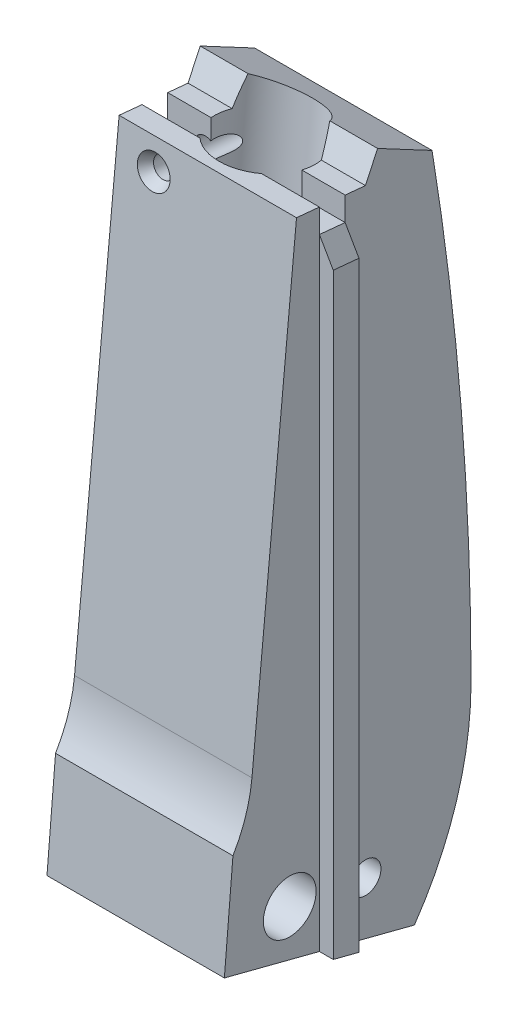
ISO-10303-21;
HEADER;
FILE_DESCRIPTION(('STEP AP214'),'2;1');
FILE_NAME('part.step','',(''),(''),'','','');
FILE_SCHEMA(('AUTOMOTIVE_DESIGN { 1 0 10303 214 1 1 1 1 }'));
ENDSEC;
DATA;
#1=APPLICATION_CONTEXT('core data for automotive mechanical design processes');
#2=APPLICATION_PROTOCOL_DEFINITION('international standard','automotive_design',2000,#1);
#3=PRODUCT_CONTEXT('',#1,'mechanical');
#4=PRODUCT('Part','Part','',(#3));
#5=PRODUCT_RELATED_PRODUCT_CATEGORY('part','',(#4));
#6=PRODUCT_DEFINITION_FORMATION('','',#4);
#7=PRODUCT_DEFINITION_CONTEXT('part definition',#1,'design');
#8=PRODUCT_DEFINITION('design','',#6,#7);
#9=PRODUCT_DEFINITION_SHAPE('','',#8);
#10=(LENGTH_UNIT() NAMED_UNIT(*) SI_UNIT(.MILLI.,.METRE.));
#11=(NAMED_UNIT(*) PLANE_ANGLE_UNIT() SI_UNIT($,.RADIAN.));
#12=(NAMED_UNIT(*) SI_UNIT($,.STERADIAN.) SOLID_ANGLE_UNIT());
#13=UNCERTAINTY_MEASURE_WITH_UNIT(LENGTH_MEASURE(1.E-05),#10,'distance_accuracy_value','');
#14=(GEOMETRIC_REPRESENTATION_CONTEXT(3) GLOBAL_UNCERTAINTY_ASSIGNED_CONTEXT((#13)) GLOBAL_UNIT_ASSIGNED_CONTEXT((#10,
#11,#12)) REPRESENTATION_CONTEXT('',''));
#15=CARTESIAN_POINT('',(0.,0.,0.));
#16=DIRECTION('',(0.,0.,1.));
#17=DIRECTION('',(1.,0.,0.));
#18=AXIS2_PLACEMENT_3D('',#15,#16,#17);
#19=CARTESIAN_POINT('',(6.8326,-21.6917123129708,-49.8602361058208));
#20=DIRECTION('',(0.,0.882947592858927,-0.469471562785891));
#21=DIRECTION('',(0.,0.469471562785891,0.882947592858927));
#22=AXIS2_PLACEMENT_3D('',#19,#20,#21);
#23=PLANE('',#22);
#24=DIRECTION('',(-1.,0.,0.));
#25=VECTOR('',#24,1.);
#26=CARTESIAN_POINT('',(6.8326,1.49828323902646,-6.24619773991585));
#27=LINE('',#26,#25);
#28=CARTESIAN_POINT('',(-3.14779837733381,1.49828323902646,-6.24619773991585));
#29=VERTEX_POINT('',#28);
#30=CARTESIAN_POINT('',(-6.8326,1.49828323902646,-6.24619773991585));
#31=VERTEX_POINT('',#30);
#32=EDGE_CURVE('E378',#29,#31,#27,.T.);
#33=ORIENTED_EDGE('',*,*,#32,.F.);
#34=CARTESIAN_POINT('',(0.,2.33888787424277,-4.66525035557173));
#35=DIRECTION('',(0.,0.882947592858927,-0.469471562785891));
#36=DIRECTION('',(0.,-0.469471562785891,-0.882947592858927));
#37=AXIS2_PLACEMENT_3D('',#34,#35,#36);
#38=ELLIPSE('',#37,3.84898666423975,3.556);
#39=CARTESIAN_POINT('',(3.14779837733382,1.49828323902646,-6.24619773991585));
#40=VERTEX_POINT('',#39);
#41=EDGE_CURVE('E359',#29,#40,#38,.F.);
#42=ORIENTED_EDGE('',*,*,#41,.T.);
#43=CARTESIAN_POINT('',(6.8326,1.49828323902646,-6.24619773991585));
#44=VERTEX_POINT('',#43);
#45=EDGE_CURVE('E357',#44,#40,#27,.T.);
#46=ORIENTED_EDGE('',*,*,#45,.F.);
#47=DIRECTION('',(0.,-0.469471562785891,-0.882947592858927));
#48=VECTOR('',#47,1.);
#49=CARTESIAN_POINT('',(6.8326,-21.6917123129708,-49.8602361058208));
#50=LINE('',#49,#48);
#51=CARTESIAN_POINT('',(6.8326,-0.731639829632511,-10.4400730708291));
#52=VERTEX_POINT('',#51);
#53=EDGE_CURVE('E487',#44,#52,#50,.T.);
#54=ORIENTED_EDGE('',*,*,#53,.T.);
#55=DIRECTION('',(-1.,0.,0.));
#56=VECTOR('',#55,1.);
#57=CARTESIAN_POINT('',(6.8326,-0.731639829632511,-10.4400730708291));
#58=LINE('',#57,#56);
#59=CARTESIAN_POINT('',(-6.8326,-0.731639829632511,-10.4400730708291));
#60=VERTEX_POINT('',#59);
#61=EDGE_CURVE('E386',#52,#60,#58,.T.);
#62=ORIENTED_EDGE('',*,*,#61,.T.);
#63=DIRECTION('',(0.,-0.469471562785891,-0.882947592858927));
#64=VECTOR('',#63,1.);
#65=CARTESIAN_POINT('',(-6.8326,-21.6917123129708,-49.8602361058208));
#66=LINE('',#65,#64);
#67=EDGE_CURVE('E417',#31,#60,#66,.T.);
#68=ORIENTED_EDGE('',*,*,#67,.F.);
#69=EDGE_LOOP('',(#33,#42,#46,#54,#62,#68));
#70=FACE_BOUND('',#69,.T.);
#71=ADVANCED_FACE('F144',(#70),#23,.T.);
#72=CARTESIAN_POINT('',(6.8326,-4.35796258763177,-3.51626625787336));
#73=DIRECTION('',(0.,0.422506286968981,0.906359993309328));
#74=DIRECTION('',(0.,-0.906359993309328,0.422506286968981));
#75=AXIS2_PLACEMENT_3D('',#72,#73,#74);
#76=PLANE('',#75);
#77=DIRECTION('',(-1.,0.,0.));
#78=VECTOR('',#77,1.);
#79=CARTESIAN_POINT('',(6.8326,-0.511241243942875,-5.30944332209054));
#80=LINE('',#79,#78);
#81=CARTESIAN_POINT('',(-3.43642381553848,-0.511241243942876,-5.30944332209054));
#82=VERTEX_POINT('',#81);
#83=CARTESIAN_POINT('',(-6.8326,-0.511241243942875,-5.30944332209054));
#84=VERTEX_POINT('',#83);
#85=EDGE_CURVE('E379',#82,#84,#80,.T.);
#86=ORIENTED_EDGE('',*,*,#85,.F.);
#87=CARTESIAN_POINT('',(0.,-2.99490750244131,-4.15166427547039));
#88=DIRECTION('',(0.,0.422506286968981,0.906359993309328));
#89=DIRECTION('',(0.,-0.906359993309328,0.422506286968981));
#90=AXIS2_PLACEMENT_3D('',#87,#88,#89);
#91=ELLIPSE('',#90,10.6565847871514,3.556);
#92=EDGE_CURVE('E361',#82,#29,#91,.F.);
#93=ORIENTED_EDGE('',*,*,#92,.T.);
#94=ORIENTED_EDGE('',*,*,#32,.T.);
#95=DIRECTION('',(0.,0.906359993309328,-0.422506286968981));
#96=VECTOR('',#95,1.);
#97=CARTESIAN_POINT('',(-6.8326,-4.35796258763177,-3.51626625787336));
#98=LINE('',#97,#96);
#99=EDGE_CURVE('E420',#84,#31,#98,.T.);
#100=ORIENTED_EDGE('',*,*,#99,.F.);
#101=EDGE_LOOP('',(#86,#93,#94,#100));
#102=FACE_BOUND('',#101,.T.);
#103=ADVANCED_FACE('F762',(#102),#76,.T.);
#104=ORIENTED_EDGE('',*,*,#45,.T.);
#105=CARTESIAN_POINT('',(3.43642381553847,-0.511241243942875,-5.30944332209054));
#106=VERTEX_POINT('',#105);
#107=EDGE_CURVE('E350',#40,#106,#91,.F.);
#108=ORIENTED_EDGE('',*,*,#107,.T.);
#109=CARTESIAN_POINT('',(6.8326,-0.511241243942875,-5.30944332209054));
#110=VERTEX_POINT('',#109);
#111=EDGE_CURVE('E355',#110,#106,#80,.T.);
#112=ORIENTED_EDGE('',*,*,#111,.F.);
#113=DIRECTION('',(0.,0.906359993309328,-0.422506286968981));
#114=VECTOR('',#113,1.);
#115=CARTESIAN_POINT('',(6.8326,-4.35796258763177,-3.51626625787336));
#116=LINE('',#115,#114);
#117=EDGE_CURVE('E490',#110,#44,#116,.T.);
#118=ORIENTED_EDGE('',*,*,#117,.T.);
#119=EDGE_LOOP('',(#104,#108,#112,#118));
#120=FACE_BOUND('',#119,.T.);
#121=ADVANCED_FACE('F352',(#120),#76,.T.);
#122=CARTESIAN_POINT('',(6.8326,-4.81401782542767,-49.9954866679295));
#123=DIRECTION('',(0.,0.995396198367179,-0.0958457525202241));
#124=DIRECTION('',(0.,0.0958457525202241,0.995396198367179));
#125=AXIS2_PLACEMENT_3D('',#122,#123,#124);
#126=PLANE('',#125);
#127=CARTESIAN_POINT('',(0.,-0.423599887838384,-4.3992530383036));
#128=DIRECTION('',(0.,0.995396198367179,-0.0958457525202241));
#129=DIRECTION('',(0.,0.0958457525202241,0.995396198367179));
#130=AXIS2_PLACEMENT_3D('',#127,#128,#129);
#131=CIRCLE('',#130,3.556);
#132=CARTESIAN_POINT('',(3.49468130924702,-0.360578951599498,-3.7447555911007));
#133=VERTEX_POINT('',#132);
#134=EDGE_CURVE('E363',#133,#106,#131,.T.);
#135=ORIENTED_EDGE('',*,*,#134,.F.);
#136=DIRECTION('',(-1.,0.,0.));
#137=VECTOR('',#136,1.);
#138=CARTESIAN_POINT('',(6.8326,-0.360578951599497,-3.7447555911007));
#139=LINE('',#138,#137);
#140=CARTESIAN_POINT('',(6.8326,-0.360578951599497,-3.7447555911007));
#141=VERTEX_POINT('',#140);
#142=EDGE_CURVE('E382',#141,#133,#139,.T.);
#143=ORIENTED_EDGE('',*,*,#142,.F.);
#144=DIRECTION('',(0.,-0.0958457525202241,-0.995396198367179));
#145=VECTOR('',#144,1.);
#146=CARTESIAN_POINT('',(6.8326,-4.81401782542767,-49.9954866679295));
#147=LINE('',#146,#145);
#148=EDGE_CURVE('E377',#141,#110,#147,.T.);
#149=ORIENTED_EDGE('',*,*,#148,.T.);
#150=ORIENTED_EDGE('',*,*,#111,.T.);
#151=EDGE_LOOP('',(#135,#143,#149,#150));
#152=FACE_BOUND('',#151,.T.);
#153=ADVANCED_FACE('F375',(#152),#126,.T.);
#154=CARTESIAN_POINT('',(6.8326,-25.113432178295,-3.7447555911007));
#155=DIRECTION('',(0.,0.,1.));
#156=DIRECTION('',(1.,0.,0.));
#157=AXIS2_PLACEMENT_3D('',#154,#155,#156);
#158=PLANE('',#157);
#159=CARTESIAN_POINT('',(0.,-7.22081576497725,-3.7447555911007));
#160=DIRECTION('',(0.,0.,1.));
#161=DIRECTION('',(0.,1.,0.));
#162=AXIS2_PLACEMENT_3D('',#159,#160,#161);
#163=ELLIPSE('',#162,37.1012789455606,3.556);
#164=CARTESIAN_POINT('',(-3.49468130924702,-0.360578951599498,-3.7447555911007));
#165=VERTEX_POINT('',#164);
#166=CARTESIAN_POINT('',(-3.51963335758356,-1.92830936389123,-3.7447555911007));
#167=VERTEX_POINT('',#166);
#168=EDGE_CURVE('E172',#165,#167,#163,.T.);
#169=ORIENTED_EDGE('',*,*,#168,.F.);
#170=CARTESIAN_POINT('',(-6.8326,-0.360578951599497,-3.7447555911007));
#171=VERTEX_POINT('',#170);
#172=EDGE_CURVE('E1110',#165,#171,#139,.T.);
#173=ORIENTED_EDGE('',*,*,#172,.T.);
#174=DIRECTION('',(0.,1.,0.));
#175=VECTOR('',#174,1.);
#176=CARTESIAN_POINT('',(-6.8326,-25.113432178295,-3.7447555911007));
#177=LINE('',#176,#175);
#178=CARTESIAN_POINT('',(-6.8326,-2.19462581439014,-3.7447555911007));
#179=VERTEX_POINT('',#178);
#180=EDGE_CURVE('E426',#179,#171,#177,.T.);
#181=ORIENTED_EDGE('',*,*,#180,.F.);
#182=DIRECTION('',(-1.,0.,0.));
#183=VECTOR('',#182,1.);
#184=CARTESIAN_POINT('',(6.8326,-2.19462581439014,-3.7447555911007));
#185=LINE('',#184,#183);
#186=CARTESIAN_POINT('',(-4.63700672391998,-2.19462581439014,-3.7447555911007));
#187=VERTEX_POINT('',#186);
#188=EDGE_CURVE('E1111',#187,#179,#185,.T.);
#189=ORIENTED_EDGE('',*,*,#188,.F.);
#190=CARTESIAN_POINT('',(-3.9497,-2.60611696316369,-3.7447555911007));
#191=DIRECTION('',(0.,0.,1.));
#192=DIRECTION('',(0.,1.,0.));
#193=AXIS2_PLACEMENT_3D('',#190,#191,#192);
#194=ELLIPSE('',#193,0.803800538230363,0.800099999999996);
#195=EDGE_CURVE('E1056',#167,#187,#194,.T.);
#196=ORIENTED_EDGE('',*,*,#195,.F.);
#197=EDGE_LOOP('',(#169,#173,#181,#189,#196));
#198=FACE_BOUND('',#197,.T.);
#199=ADVANCED_FACE('F813',(#198),#158,.T.);
#200=CARTESIAN_POINT('',(6.8326,-6.63121638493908,-49.8205103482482));
#201=DIRECTION('',(0.,0.995396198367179,-0.0958457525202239));
#202=DIRECTION('',(0.,0.0958457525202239,0.995396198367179));
#203=AXIS2_PLACEMENT_3D('',#200,#201,#202);
#204=PLANE('',#203);
#205=CARTESIAN_POINT('',(0.,-2.24079844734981,-4.2242767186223));
#206=DIRECTION('',(0.,0.995396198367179,-0.0958457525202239));
#207=DIRECTION('',(0.,0.0958457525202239,0.995396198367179));
#208=AXIS2_PLACEMENT_3D('',#205,#206,#207);
#209=CIRCLE('',#208,3.556);
#210=CARTESIAN_POINT('',(2.55613902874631,-2.00385795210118,-1.7635555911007));
#211=VERTEX_POINT('',#210);
#212=CARTESIAN_POINT('',(3.52321778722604,-2.19462581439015,-3.7447555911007));
#213=VERTEX_POINT('',#212);
#214=EDGE_CURVE('E1043',#211,#213,#209,.T.);
#215=ORIENTED_EDGE('',*,*,#214,.F.);
#216=DIRECTION('',(-1.,0.,0.));
#217=VECTOR('',#216,1.);
#218=CARTESIAN_POINT('',(6.8326,-2.00385795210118,-1.7635555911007));
#219=LINE('',#218,#217);
#220=CARTESIAN_POINT('',(6.8326,-2.00385795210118,-1.7635555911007));
#221=VERTEX_POINT('',#220);
#222=EDGE_CURVE('E1109',#221,#211,#219,.T.);
#223=ORIENTED_EDGE('',*,*,#222,.F.);
#224=DIRECTION('',(0.,0.0958457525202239,0.995396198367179));
#225=VECTOR('',#224,1.);
#226=CARTESIAN_POINT('',(6.8326,-3.5748120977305,-18.0785381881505));
#227=LINE('',#226,#225);
#228=CARTESIAN_POINT('',(6.8326,-2.19462581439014,-3.7447555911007));
#229=VERTEX_POINT('',#228);
#230=EDGE_CURVE('E1060',#229,#221,#227,.T.);
#231=ORIENTED_EDGE('',*,*,#230,.F.);
#232=EDGE_CURVE('E1107',#229,#213,#185,.T.);
#233=ORIENTED_EDGE('',*,*,#232,.T.);
#234=EDGE_LOOP('',(#215,#223,#231,#233));
#235=FACE_BOUND('',#234,.T.);
#236=ADVANCED_FACE('F796',(#235),#204,.T.);
#237=CARTESIAN_POINT('',(6.8326,-25.113432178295,-1.7635555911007));
#238=DIRECTION('',(0.,0.,-1.));
#239=DIRECTION('',(0.,1.,0.));
#240=AXIS2_PLACEMENT_3D('',#237,#238,#239);
#241=PLANE('',#240);
#242=CARTESIAN_POINT('',(0.,-27.796364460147,-1.7635555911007));
#243=DIRECTION('',(0.,0.,-1.));
#244=DIRECTION('',(0.,1.,0.));
#245=AXIS2_PLACEMENT_3D('',#242,#243,#244);
#246=ELLIPSE('',#245,37.1012789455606,3.556);
#247=CARTESIAN_POINT('',(2.37356824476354,-0.169811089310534,-1.7635555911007));
#248=VERTEX_POINT('',#247);
#249=EDGE_CURVE('E1166',#248,#211,#246,.T.);
#250=ORIENTED_EDGE('',*,*,#249,.F.);
#251=DIRECTION('',(-1.,0.,0.));
#252=VECTOR('',#251,1.);
#253=CARTESIAN_POINT('',(6.8326,-0.169811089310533,-1.7635555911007));
#254=LINE('',#253,#252);
#255=CARTESIAN_POINT('',(6.8326,-0.169811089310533,-1.7635555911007));
#256=VERTEX_POINT('',#255);
#257=EDGE_CURVE('E1116',#256,#248,#254,.T.);
#258=ORIENTED_EDGE('',*,*,#257,.F.);
#259=DIRECTION('',(0.,-1.,0.));
#260=VECTOR('',#259,1.);
#261=CARTESIAN_POINT('',(6.8326,-25.113432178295,-1.7635555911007));
#262=LINE('',#261,#260);
#263=EDGE_CURVE('E496',#256,#221,#262,.T.);
#264=ORIENTED_EDGE('',*,*,#263,.T.);
#265=ORIENTED_EDGE('',*,*,#222,.T.);
#266=EDGE_LOOP('',(#250,#258,#264,#265));
#267=FACE_BOUND('',#266,.T.);
#268=ADVANCED_FACE('F792',(#267),#241,.T.);
#269=DIRECTION('',(0.,0.095845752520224,0.995396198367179));
#270=VECTOR('',#269,1.);
#271=CARTESIAN_POINT('',(-4.63700672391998,-1.81719855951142,0.174976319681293));
#272=LINE('',#271,#270);
#273=CARTESIAN_POINT('',(-4.63700672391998,-2.00385795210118,-1.7635555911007));
#274=VERTEX_POINT('',#273);
#275=EDGE_CURVE('E1054',#187,#274,#272,.T.);
#276=ORIENTED_EDGE('',*,*,#275,.F.);
#277=ORIENTED_EDGE('',*,*,#188,.T.);
#278=DIRECTION('',(0.,0.0958457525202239,0.995396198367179));
#279=VECTOR('',#278,1.);
#280=CARTESIAN_POINT('',(-6.8326,-3.5748120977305,-18.0785381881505));
#281=LINE('',#280,#279);
#282=CARTESIAN_POINT('',(-6.8326,-2.00385795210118,-1.7635555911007));
#283=VERTEX_POINT('',#282);
#284=EDGE_CURVE('E1068',#179,#283,#281,.T.);
#285=ORIENTED_EDGE('',*,*,#284,.T.);
#286=EDGE_CURVE('E1115',#274,#283,#219,.T.);
#287=ORIENTED_EDGE('',*,*,#286,.F.);
#288=EDGE_LOOP('',(#276,#277,#285,#287));
#289=FACE_BOUND('',#288,.T.);
#290=ADVANCED_FACE('F759',(#289),#204,.T.);
#291=CARTESIAN_POINT('',(-6.8326,-25.113432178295,-48.0408753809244));
#292=DIRECTION('',(1.,0.,0.));
#293=DIRECTION('',(0.,0.,-1.));
#294=AXIS2_PLACEMENT_3D('',#291,#292,#293);
#295=PLANE('',#294);
#296=CARTESIAN_POINT('',(-6.8326,-45.6770138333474,0.5224444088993));
#297=DIRECTION('',(1.,0.,0.));
#298=DIRECTION('',(0.,0.,-1.));
#299=AXIS2_PLACEMENT_3D('',#296,#297,#298);
#300=CIRCLE('',#299,2.032);
#301=CARTESIAN_POINT('',(-6.8326,-45.6770138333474,-1.5095555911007));
#302=VERTEX_POINT('',#301);
#303=EDGE_CURVE('E447',#302,#302,#300,.T.);
#304=ORIENTED_EDGE('',*,*,#303,.T.);
#305=EDGE_LOOP('',(#304));
#306=FACE_BOUND('',#305,.T.);
#307=DIRECTION('',(0.,-1.,0.));
#308=VECTOR('',#307,1.);
#309=CARTESIAN_POINT('',(-6.8326,-25.113432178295,-1.7635555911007));
#310=LINE('',#309,#308);
#311=CARTESIAN_POINT('',(-6.8326,-0.169811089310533,-1.7635555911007));
#312=VERTEX_POINT('',#311);
#313=EDGE_CURVE('E429',#312,#283,#310,.T.);
#314=ORIENTED_EDGE('',*,*,#313,.T.);
#315=DIRECTION('',(0.,-1.,0.));
#316=VECTOR('',#315,1.);
#317=CARTESIAN_POINT('',(-6.8326,-2.00385795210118,-1.7635555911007));
#318=LINE('',#317,#316);
#319=CARTESIAN_POINT('',(-6.8326,-49.8321148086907,-1.7635555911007));
#320=VERTEX_POINT('',#319);
#321=EDGE_CURVE('E1078',#283,#320,#318,.T.);
#322=ORIENTED_EDGE('',*,*,#321,.T.);
#323=DIRECTION('',(0.,-0.250380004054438,-0.968147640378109));
#324=VECTOR('',#323,1.);
#325=CARTESIAN_POINT('',(-6.8326,-59.5003418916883,-39.1478158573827));
#326=LINE('',#325,#324);
#327=CARTESIAN_POINT('',(-6.8326,-47.9390820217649,5.55625907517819));
#328=VERTEX_POINT('',#327);
#329=EDGE_CURVE('E453',#328,#320,#326,.T.);
#330=ORIENTED_EDGE('',*,*,#329,.F.);
#331=DIRECTION('',(0.,0.996465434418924,-0.0840037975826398));
#332=VECTOR('',#331,1.);
#333=CARTESIAN_POINT('',(-6.8326,-20.7880555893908,3.26737955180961));
#334=LINE('',#333,#332);
#335=CARTESIAN_POINT('',(-6.8326,-40.1126393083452,4.89647611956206));
#336=VERTEX_POINT('',#335);
#337=EDGE_CURVE('E441',#328,#336,#334,.T.);
#338=ORIENTED_EDGE('',*,*,#337,.T.);
#339=CARTESIAN_POINT('',(-6.8326,-34.6217679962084,14.1020725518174));
#340=DIRECTION('',(1.,0.,0.));
#341=DIRECTION('',(0.,0.,-1.));
#342=AXIS2_PLACEMENT_3D('',#339,#340,#341);
#343=CIRCLE('',#342,10.7188);
#344=CARTESIAN_POINT('',(-6.8326,-35.6491194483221,3.43261978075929));
#345=VERTEX_POINT('',#344);
#346=EDGE_CURVE('E438',#336,#345,#343,.T.);
#347=ORIENTED_EDGE('',*,*,#346,.T.);
#348=DIRECTION('',(0.,-0.995396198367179,0.095845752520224));
#349=VECTOR('',#348,1.);
#350=CARTESIAN_POINT('',(-6.8326,-20.2994143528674,1.95461128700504));
#351=LINE('',#350,#349);
#352=CARTESIAN_POINT('',(-6.8326,0.,0.));
#353=VERTEX_POINT('',#352);
#354=EDGE_CURVE('E435',#353,#345,#351,.T.);
#355=ORIENTED_EDGE('',*,*,#354,.F.);
#356=DIRECTION('',(0.,-0.0958457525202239,-0.995396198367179));
#357=VECTOR('',#356,1.);
#358=CARTESIAN_POINT('',(-6.8326,-4.81401782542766,-49.9954866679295));
#359=LINE('',#358,#357);
#360=EDGE_CURVE('E432',#353,#312,#359,.T.);
#361=ORIENTED_EDGE('',*,*,#360,.T.);
#362=EDGE_LOOP('',(#314,#322,#330,#338,#347,#355,#361));
#363=FACE_BOUND('',#362,.T.);
#364=ADVANCED_FACE('F754',(#306,#363),#295,.F.);
#365=CARTESIAN_POINT('',(6.8326,-25.113432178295,-48.0408753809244));
#366=DIRECTION('',(1.,0.,0.));
#367=DIRECTION('',(0.,0.,-1.));
#368=AXIS2_PLACEMENT_3D('',#365,#366,#367);
#369=PLANE('',#368);
#370=CARTESIAN_POINT('',(6.8326,-37.6579618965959,215.157814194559));
#371=DIRECTION('',(1.,0.,0.));
#372=DIRECTION('',(0.,0.,-1.));
#373=AXIS2_PLACEMENT_3D('',#370,#371,#372);
#374=CIRCLE('',#373,228.6);
#375=CARTESIAN_POINT('',(6.8326,-37.7418653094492,-13.4421704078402));
#376=VERTEX_POINT('',#375);
#377=EDGE_CURVE('E485',#376,#52,#374,.T.);
#378=ORIENTED_EDGE('',*,*,#377,.T.);
#379=ORIENTED_EDGE('',*,*,#53,.F.);
#380=ORIENTED_EDGE('',*,*,#117,.F.);
#381=ORIENTED_EDGE('',*,*,#148,.F.);
#382=DIRECTION('',(0.,1.,0.));
#383=VECTOR('',#382,1.);
#384=CARTESIAN_POINT('',(6.8326,-25.113432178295,-3.7447555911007));
#385=LINE('',#384,#383);
#386=EDGE_CURVE('E493',#229,#141,#385,.T.);
#387=ORIENTED_EDGE('',*,*,#386,.F.);
#388=DIRECTION('',(0.,1.,0.));
#389=VECTOR('',#388,1.);
#390=CARTESIAN_POINT('',(6.8326,-2.19462581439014,-3.7447555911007));
#391=LINE('',#390,#389);
#392=CARTESIAN_POINT('',(6.8326,-50.3444879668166,-3.74475559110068));
#393=VERTEX_POINT('',#392);
#394=EDGE_CURVE('E464',#393,#229,#391,.T.);
#395=ORIENTED_EDGE('',*,*,#394,.F.);
#396=DIRECTION('',(0.,-0.250380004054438,-0.968147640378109));
#397=VECTOR('',#396,1.);
#398=CARTESIAN_POINT('',(6.8326,-59.5003418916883,-39.1478158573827));
#399=LINE('',#398,#397);
#400=CARTESIAN_POINT('',(6.8326,-51.7251475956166,-9.08337025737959));
#401=VERTEX_POINT('',#400);
#402=EDGE_CURVE('E397',#393,#401,#399,.T.);
#403=ORIENTED_EDGE('',*,*,#402,.T.);
#404=CARTESIAN_POINT('',(6.8326,-37.7328223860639,11.1958279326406));
#405=DIRECTION('',(1.,0.,0.));
#406=DIRECTION('',(0.,0.,-1.));
#407=AXIS2_PLACEMENT_3D('',#404,#405,#406);
#408=CIRCLE('',#407,24.638);
#409=EDGE_CURVE('E482',#401,#376,#408,.T.);
#410=ORIENTED_EDGE('',*,*,#409,.T.);
#411=EDGE_LOOP('',(#378,#379,#380,#381,#387,#395,#403,#410));
#412=FACE_BOUND('',#411,.T.);
#413=CARTESIAN_POINT('',(6.8326,-46.6826776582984,-5.30968483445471));
#414=DIRECTION('',(1.,0.,0.));
#415=DIRECTION('',(0.,0.,-1.));
#416=AXIS2_PLACEMENT_3D('',#413,#414,#415);
#417=CIRCLE('',#416,1.1938);
#418=CARTESIAN_POINT('',(6.8326,-46.6826776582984,-6.50348483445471));
#419=VERTEX_POINT('',#418);
#420=EDGE_CURVE('E479',#419,#419,#417,.T.);
#421=ORIENTED_EDGE('',*,*,#420,.F.);
#422=EDGE_LOOP('',(#421));
#423=FACE_BOUND('',#422,.T.);
#424=ADVANCED_FACE('F513',(#412,#423),#369,.T.);
#425=CARTESIAN_POINT('',(6.8326,-37.7328223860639,11.1958279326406));
#426=DIRECTION('',(-1.,0.,0.));
#427=DIRECTION('',(0.,0.,1.));
#428=AXIS2_PLACEMENT_3D('',#425,#426,#427);
#429=CYLINDRICAL_SURFACE('',#428,24.638);
#430=CARTESIAN_POINT('',(-6.8326,-37.7328223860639,11.1958279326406));
#431=DIRECTION('',(1.,0.,0.));
#432=DIRECTION('',(0.,0.,-1.));
#433=AXIS2_PLACEMENT_3D('',#430,#431,#432);
#434=CIRCLE('',#433,24.638);
#435=CARTESIAN_POINT('',(-6.8326,-51.7251475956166,-9.08337025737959));
#436=VERTEX_POINT('',#435);
#437=CARTESIAN_POINT('',(-6.8326,-37.7418653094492,-13.4421704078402));
#438=VERTEX_POINT('',#437);
#439=EDGE_CURVE('E411',#436,#438,#434,.T.);
#440=ORIENTED_EDGE('',*,*,#439,.T.);
#441=DIRECTION('',(-1.,0.,0.));
#442=VECTOR('',#441,1.);
#443=CARTESIAN_POINT('',(6.8326,-37.7418653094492,-13.4421704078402));
#444=LINE('',#443,#442);
#445=EDGE_CURVE('E389',#376,#438,#444,.T.);
#446=ORIENTED_EDGE('',*,*,#445,.F.);
#447=ORIENTED_EDGE('',*,*,#409,.F.);
#448=DIRECTION('',(-1.,0.,0.));
#449=VECTOR('',#448,1.);
#450=CARTESIAN_POINT('',(6.8326,-51.7251475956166,-9.08337025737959));
#451=LINE('',#450,#449);
#452=EDGE_CURVE('E407',#401,#436,#451,.T.);
#453=ORIENTED_EDGE('',*,*,#452,.T.);
#454=EDGE_LOOP('',(#440,#446,#447,#453));
#455=FACE_BOUND('',#454,.T.);
#456=ADVANCED_FACE('F526',(#455),#429,.T.);
#457=CARTESIAN_POINT('',(6.8326,-37.6579618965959,215.157814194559));
#458=DIRECTION('',(-1.,0.,0.));
#459=DIRECTION('',(0.,0.,1.));
#460=AXIS2_PLACEMENT_3D('',#457,#458,#459);
#461=CYLINDRICAL_SURFACE('',#460,228.6);
#462=CARTESIAN_POINT('',(-3.9497,-4.10528654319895,-10.9664392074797));
#463=CARTESIAN_POINT('',(-3.90574190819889,-4.1052843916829,-10.9664389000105));
#464=CARTESIAN_POINT('',(-3.86175098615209,-4.10158012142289,-10.9658893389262));
#465=CARTESIAN_POINT('',(-3.77499808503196,-4.08687406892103,-10.9637064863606));
#466=CARTESIAN_POINT('',(-3.73223768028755,-4.07586333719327,-10.9620718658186));
#467=CARTESIAN_POINT('',(-3.64923435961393,-4.04692052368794,-10.9577715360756));
#468=CARTESIAN_POINT('',(-3.60898874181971,-4.02899602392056,-10.9551069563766));
#469=CARTESIAN_POINT('',(-3.53207124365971,-3.98680543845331,-10.9488280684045));
#470=CARTESIAN_POINT('',(-3.49539865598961,-3.96254061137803,-10.9452139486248));
#471=CARTESIAN_POINT('',(-3.42612185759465,-3.90806588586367,-10.9370890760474));
#472=CARTESIAN_POINT('',(-3.39357541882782,-3.87778419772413,-10.9325674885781));
#473=CARTESIAN_POINT('',(-3.33391310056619,-3.81237877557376,-10.9227855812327));
#474=CARTESIAN_POINT('',(-3.30679807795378,-3.77725427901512,-10.9175251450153));
#475=CARTESIAN_POINT('',(-3.25796116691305,-3.70211813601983,-10.9062522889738));
#476=CARTESIAN_POINT('',(-3.23641102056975,-3.66199740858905,-10.900222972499));
#477=CARTESIAN_POINT('',(-3.20021942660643,-3.57882058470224,-10.8876986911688));
#478=CARTESIAN_POINT('',(-3.18557900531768,-3.53576405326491,-10.8812036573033));
#479=CARTESIAN_POINT('',(-3.16322809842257,-3.44667732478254,-10.8677376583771));
#480=CARTESIAN_POINT('',(-3.15571806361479,-3.40059800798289,-10.8607585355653));
#481=CARTESIAN_POINT('',(-3.14849749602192,-3.30784861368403,-10.8466811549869));
#482=CARTESIAN_POINT('',(-3.14878779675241,-3.26117847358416,-10.8395828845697));
#483=CARTESIAN_POINT('',(-3.15722420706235,-3.16781496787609,-10.8253533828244));
#484=CARTESIAN_POINT('',(-3.16549089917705,-3.1211322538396,-10.8182233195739));
#485=CARTESIAN_POINT('',(-3.18986389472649,-3.02981174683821,-10.804247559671));
#486=CARTESIAN_POINT('',(-3.20597032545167,-2.98517398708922,-10.7974018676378));
#487=CARTESIAN_POINT('',(-3.24555633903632,-2.89942730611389,-10.7842273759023));
#488=CARTESIAN_POINT('',(-3.26900657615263,-2.85830515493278,-10.7778966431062));
#489=CARTESIAN_POINT('',(-3.32271083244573,-2.78065593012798,-10.7659231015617));
#490=CARTESIAN_POINT('',(-3.35296411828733,-2.74412836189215,-10.7602802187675));
#491=CARTESIAN_POINT('',(-3.41871549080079,-2.67760830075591,-10.749989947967));
#492=CARTESIAN_POINT('',(-3.45408079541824,-2.64748766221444,-10.7453230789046));
#493=CARTESIAN_POINT('',(-3.52956504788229,-2.59376752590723,-10.7369910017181));
#494=CARTESIAN_POINT('',(-3.56968311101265,-2.57016681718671,-10.7333256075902));
#495=CARTESIAN_POINT('',(-3.6521983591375,-2.53092710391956,-10.7272269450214));
#496=CARTESIAN_POINT('',(-3.69448659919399,-2.51506432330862,-10.7247590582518));
#497=CARTESIAN_POINT('',(-3.78119716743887,-2.49078176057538,-10.7209798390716));
#498=CARTESIAN_POINT('',(-3.82561914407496,-2.48236075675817,-10.7196683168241));
#499=CARTESIAN_POINT('',(-3.9141521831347,-2.47337104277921,-10.7182681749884));
#500=CARTESIAN_POINT('',(-3.95824361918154,-2.47261271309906,-10.7181500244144));
#501=CARTESIAN_POINT('',(-4.04591805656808,-2.47847998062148,-10.7190639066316));
#502=CARTESIAN_POINT('',(-4.08950109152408,-2.48510508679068,-10.7200958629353));
#503=CARTESIAN_POINT('',(-4.17460537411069,-2.50543995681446,-10.7232613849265));
#504=CARTESIAN_POINT('',(-4.21613913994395,-2.51909870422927,-10.7253870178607));
#505=CARTESIAN_POINT('',(-4.29634022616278,-2.55302551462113,-10.7306621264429));
#506=CARTESIAN_POINT('',(-4.33500742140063,-2.57329386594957,-10.7338116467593));
#507=CARTESIAN_POINT('',(-4.40894905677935,-2.62011462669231,-10.7410787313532));
#508=CARTESIAN_POINT('',(-4.44417184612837,-2.64674662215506,-10.7452085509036));
#509=CARTESIAN_POINT('',(-4.50974417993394,-2.70533510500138,-10.7542810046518));
#510=CARTESIAN_POINT('',(-4.54009311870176,-2.73729225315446,-10.7592237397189));
#511=CARTESIAN_POINT('',(-4.59594855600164,-2.80654893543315,-10.7699182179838));
#512=CARTESIAN_POINT('',(-4.62130005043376,-2.84397060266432,-10.775688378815));
#513=CARTESIAN_POINT('',(-4.6655004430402,-2.92239590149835,-10.7877589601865));
#514=CARTESIAN_POINT('',(-4.68434834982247,-2.96340007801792,-10.7940594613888));
#515=CARTESIAN_POINT('',(-4.71557555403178,-3.04912961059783,-10.8072066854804));
#516=CARTESIAN_POINT('',(-4.72774666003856,-3.09392922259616,-10.8140640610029));
#517=CARTESIAN_POINT('',(-4.74446937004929,-3.1849026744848,-10.8279603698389));
#518=CARTESIAN_POINT('',(-4.74902000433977,-3.23107668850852,-10.834999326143));
#519=CARTESIAN_POINT('',(-4.7504091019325,-3.32444022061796,-10.8492024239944));
#520=CARTESIAN_POINT('',(-4.74709658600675,-3.37163209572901,-10.8563663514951));
#521=CARTESIAN_POINT('',(-4.73251422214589,-3.46480609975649,-10.8704811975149));
#522=CARTESIAN_POINT('',(-4.72124405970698,-3.51078818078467,-10.8774321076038));
#523=CARTESIAN_POINT('',(-4.69099601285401,-3.6002475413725,-10.8909286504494));
#524=CARTESIAN_POINT('',(-4.67201280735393,-3.64372306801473,-10.8974739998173));
#525=CARTESIAN_POINT('',(-4.62680196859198,-3.7268255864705,-10.9099627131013));
#526=CARTESIAN_POINT('',(-4.60057518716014,-3.76645303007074,-10.9159061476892));
#527=CARTESIAN_POINT('',(-4.54210784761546,-3.83992270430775,-10.9269079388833));
#528=CARTESIAN_POINT('',(-4.50998752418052,-3.87385840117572,-10.9319806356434));
#529=CARTESIAN_POINT('',(-4.44027922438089,-3.93572897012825,-10.9412171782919));
#530=CARTESIAN_POINT('',(-4.40269073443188,-3.96366327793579,-10.9453809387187));
#531=CARTESIAN_POINT('',(-4.32427893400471,-4.01186659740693,-10.9525589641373));
#532=CARTESIAN_POINT('',(-4.28357888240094,-4.03233198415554,-10.9556026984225));
#533=CARTESIAN_POINT('',(-4.19925036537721,-4.06597675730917,-10.9606035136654));
#534=CARTESIAN_POINT('',(-4.15562624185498,-4.07916668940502,-10.9625621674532));
#535=CARTESIAN_POINT('',(-4.08467875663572,-4.09407434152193,-10.9647753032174));
#536=CARTESIAN_POINT('',(-4.05786355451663,-4.09827285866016,-10.9653984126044));
#537=CARTESIAN_POINT('',(-4.00393639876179,-4.10387960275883,-10.9662304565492));
#538=CARTESIAN_POINT('',(-3.97682444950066,-4.10528787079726,-10.9664393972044));
#539=CARTESIAN_POINT('',(-3.9497,-4.10528654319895,-10.9664392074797));
#540=B_SPLINE_CURVE_WITH_KNOTS('',3,(#462,#463,#464,#465,#466,#467,#468,#469,#470,#471,#472,
#473,#474,#475,#476,#477,#478,#479,#480,#481,#482,#483,#484,#485,#486,#487,#488,#489,#490,#491,
#492,#493,#494,#495,#496,#497,#498,#499,#500,#501,#502,#503,#504,#505,#506,#507,#508,#509,#510,
#511,#512,#513,#514,#515,#516,#517,#518,#519,#520,#521,#522,#523,#524,#525,#526,#527,#528,#529,
#530,#531,#532,#533,#534,#535,#536,#537,#538,#539),.UNSPECIFIED.,.T.,.F.,(4,2,2,2,2,2,2,2,2,2,2,
2,2,2,2,2,2,2,2,2,2,2,2,2,2,2,2,2,2,2,2,2,2,2,2,2,2,2,4),(0.,0.13177365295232,0.263709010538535,
0.39550009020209,0.527265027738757,0.660708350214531,0.794172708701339,0.931363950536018,
1.06857556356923,1.20953930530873,1.35051810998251,1.4936620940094,1.63680840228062,
1.77938984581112,1.9219559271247,2.06132596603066,2.20067010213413,2.33570221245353,
2.47071215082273,2.60237271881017,2.73402453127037,2.86473462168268,2.9954504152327,
3.12789547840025,3.26035698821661,3.39643850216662,3.53254075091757,3.67267533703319,
3.81282775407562,3.95569291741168,4.09856372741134,4.24153326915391,4.38448600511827,
4.52479403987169,4.66511526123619,4.80142337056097,4.93753338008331,5.01884583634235,
5.10015709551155),.UNSPECIFIED.);
#541=CARTESIAN_POINT('',(-3.9497,-4.10528654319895,-10.9664392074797));
#542=VERTEX_POINT('',#541);
#543=EDGE_CURVE('E702',#542,#542,#540,.T.);
#544=ORIENTED_EDGE('',*,*,#543,.T.);
#545=EDGE_LOOP('',(#544));
#546=FACE_BOUND('',#545,.T.);
#547=CARTESIAN_POINT('',(-6.8326,-37.6579618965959,215.157814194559));
#548=DIRECTION('',(1.,0.,0.));
#549=DIRECTION('',(0.,0.,-1.));
#550=AXIS2_PLACEMENT_3D('',#547,#548,#549);
#551=CIRCLE('',#550,228.6);
#552=EDGE_CURVE('E415',#438,#60,#551,.T.);
#553=ORIENTED_EDGE('',*,*,#552,.T.);
#554=ORIENTED_EDGE('',*,*,#61,.F.);
#555=ORIENTED_EDGE('',*,*,#377,.F.);
#556=ORIENTED_EDGE('',*,*,#445,.T.);
#557=EDGE_LOOP('',(#553,#554,#555,#556));
#558=FACE_BOUND('',#557,.T.);
#559=ADVANCED_FACE('F528',(#546,#558),#461,.T.);
#560=EDGE_CURVE('E371',#82,#165,#131,.T.);
#561=ORIENTED_EDGE('',*,*,#560,.F.);
#562=ORIENTED_EDGE('',*,*,#85,.T.);
#563=DIRECTION('',(0.,-0.0958457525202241,-0.995396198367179));
#564=VECTOR('',#563,1.);
#565=CARTESIAN_POINT('',(-6.8326,-4.81401782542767,-49.9954866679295));
#566=LINE('',#565,#564);
#567=EDGE_CURVE('E423',#171,#84,#566,.T.);
#568=ORIENTED_EDGE('',*,*,#567,.F.);
#569=ORIENTED_EDGE('',*,*,#172,.F.);
#570=EDGE_LOOP('',(#561,#562,#568,#569));
#571=FACE_BOUND('',#570,.T.);
#572=ADVANCED_FACE('F772',(#571),#126,.T.);
#573=EDGE_CURVE('E367',#213,#133,#163,.T.);
#574=ORIENTED_EDGE('',*,*,#573,.F.);
#575=ORIENTED_EDGE('',*,*,#232,.F.);
#576=ORIENTED_EDGE('',*,*,#386,.T.);
#577=ORIENTED_EDGE('',*,*,#142,.T.);
#578=EDGE_LOOP('',(#574,#575,#576,#577));
#579=FACE_BOUND('',#578,.T.);
#580=ADVANCED_FACE('F822',(#579),#158,.T.);
#581=CARTESIAN_POINT('',(-3.26239327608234,-2.10518683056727,-2.81589622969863));
#582=VERTEX_POINT('',#581);
#583=CARTESIAN_POINT('',(-2.55613902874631,-2.00385795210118,-1.76355559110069));
#584=VERTEX_POINT('',#583);
#585=EDGE_CURVE('E370',#582,#584,#209,.T.);
#586=ORIENTED_EDGE('',*,*,#585,.F.);
#587=DIRECTION('',(0.,0.095845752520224,0.995396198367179));
#588=VECTOR('',#587,1.);
#589=CARTESIAN_POINT('',(-3.26239327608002,-1.81719855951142,0.174976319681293));
#590=LINE('',#589,#588);
#591=CARTESIAN_POINT('',(-3.26239327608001,-2.00385795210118,-1.7635555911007));
#592=VERTEX_POINT('',#591);
#593=EDGE_CURVE('E1051',#592,#582,#590,.F.);
#594=ORIENTED_EDGE('',*,*,#593,.F.);
#595=EDGE_CURVE('E1114',#584,#592,#219,.T.);
#596=ORIENTED_EDGE('',*,*,#595,.F.);
#597=EDGE_LOOP('',(#586,#594,#596));
#598=FACE_BOUND('',#597,.T.);
#599=ADVANCED_FACE('F795',(#598),#204,.T.);
#600=CARTESIAN_POINT('',(-2.37356824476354,-0.169811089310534,-1.7635555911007));
#601=VERTEX_POINT('',#600);
#602=EDGE_CURVE('E1046',#584,#601,#246,.T.);
#603=ORIENTED_EDGE('',*,*,#602,.F.);
#604=ORIENTED_EDGE('',*,*,#595,.T.);
#605=CARTESIAN_POINT('',(-3.9497,-2.41534910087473,-1.7635555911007));
#606=DIRECTION('',(0.,0.,-1.));
#607=DIRECTION('',(0.,1.,0.));
#608=AXIS2_PLACEMENT_3D('',#605,#606,#607);
#609=ELLIPSE('',#608,0.803800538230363,0.800099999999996);
#610=EDGE_CURVE('E1048',#274,#592,#609,.T.);
#611=ORIENTED_EDGE('',*,*,#610,.F.);
#612=ORIENTED_EDGE('',*,*,#286,.T.);
#613=ORIENTED_EDGE('',*,*,#313,.F.);
#614=EDGE_CURVE('E1119',#601,#312,#254,.T.);
#615=ORIENTED_EDGE('',*,*,#614,.F.);
#616=EDGE_LOOP('',(#603,#604,#611,#612,#613,#615));
#617=FACE_BOUND('',#616,.T.);
#618=ADVANCED_FACE('F806',(#617),#241,.T.);
#619=CARTESIAN_POINT('',(6.8326,-4.81401782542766,-49.9954866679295));
#620=DIRECTION('',(0.,0.995396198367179,-0.0958457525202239));
#621=DIRECTION('',(0.,0.095845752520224,0.995396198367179));
#622=AXIS2_PLACEMENT_3D('',#619,#620,#621);
#623=PLANE('',#622);
#624=EDGE_CURVE('E373',#601,#248,#131,.T.);
#625=ORIENTED_EDGE('',*,*,#624,.F.);
#626=ORIENTED_EDGE('',*,*,#614,.T.);
#627=ORIENTED_EDGE('',*,*,#360,.F.);
#628=DIRECTION('',(-1.,0.,0.));
#629=VECTOR('',#628,1.);
#630=CARTESIAN_POINT('',(6.8326,0.,0.));
#631=LINE('',#630,#629);
#632=CARTESIAN_POINT('',(6.8326,0.,0.));
#633=VERTEX_POINT('',#632);
#634=EDGE_CURVE('E1120',#633,#353,#631,.T.);
#635=ORIENTED_EDGE('',*,*,#634,.F.);
#636=DIRECTION('',(0.,-0.0958457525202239,-0.995396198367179));
#637=VECTOR('',#636,1.);
#638=CARTESIAN_POINT('',(6.8326,-4.81401782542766,-49.9954866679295));
#639=LINE('',#638,#637);
#640=EDGE_CURVE('E499',#633,#256,#639,.T.);
#641=ORIENTED_EDGE('',*,*,#640,.T.);
#642=ORIENTED_EDGE('',*,*,#257,.T.);
#643=EDGE_LOOP('',(#625,#626,#627,#635,#641,#642));
#644=FACE_BOUND('',#643,.T.);
#645=ADVANCED_FACE('F943',(#644),#623,.T.);
#646=CARTESIAN_POINT('',(6.8326,-20.2994143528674,1.95461128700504));
#647=DIRECTION('',(0.,-0.095845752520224,-0.995396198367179));
#648=DIRECTION('',(0.,0.995396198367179,-0.095845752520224));
#649=AXIS2_PLACEMENT_3D('',#646,#647,#648);
#650=PLANE('',#649);
#651=CARTESIAN_POINT('',(-3.9497,-2.22490958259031,0.214234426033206));
#652=DIRECTION('',(0.,0.095845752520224,0.995396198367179));
#653=DIRECTION('',(0.,-0.995396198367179,0.095845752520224));
#654=AXIS2_PLACEMENT_3D('',#651,#652,#653);
#655=CIRCLE('',#654,1.2573);
#656=CARTESIAN_POINT('',(-3.9497,-3.47642122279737,0.334741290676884));
#657=VERTEX_POINT('',#656);
#658=EDGE_CURVE('E1040',#657,#657,#655,.T.);
#659=ORIENTED_EDGE('',*,*,#658,.F.);
#660=EDGE_LOOP('',(#659));
#661=FACE_BOUND('',#660,.T.);
#662=ORIENTED_EDGE('',*,*,#354,.T.);
#663=DIRECTION('',(-1.,0.,0.));
#664=VECTOR('',#663,1.);
#665=CARTESIAN_POINT('',(6.8326,-35.6491194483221,3.43261978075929));
#666=LINE('',#665,#664);
#667=CARTESIAN_POINT('',(6.8326,-35.6491194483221,3.43261978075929));
#668=VERTEX_POINT('',#667);
#669=EDGE_CURVE('E1122',#668,#345,#666,.T.);
#670=ORIENTED_EDGE('',*,*,#669,.F.);
#671=DIRECTION('',(0.,-0.995396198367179,0.095845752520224));
#672=VECTOR('',#671,1.);
#673=CARTESIAN_POINT('',(6.8326,-20.2994143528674,1.95461128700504));
#674=LINE('',#673,#672);
#675=EDGE_CURVE('E502',#633,#668,#674,.T.);
#676=ORIENTED_EDGE('',*,*,#675,.F.);
#677=ORIENTED_EDGE('',*,*,#634,.T.);
#678=EDGE_LOOP('',(#662,#670,#676,#677));
#679=FACE_BOUND('',#678,.T.);
#680=ADVANCED_FACE('F948',(#661,#679),#650,.F.);
#681=CARTESIAN_POINT('',(6.8326,-34.6217679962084,14.1020725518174));
#682=DIRECTION('',(-1.,0.,0.));
#683=DIRECTION('',(0.,0.,1.));
#684=AXIS2_PLACEMENT_3D('',#681,#682,#683);
#685=CYLINDRICAL_SURFACE('',#684,10.7188);
#686=ORIENTED_EDGE('',*,*,#346,.F.);
#687=DIRECTION('',(-1.,0.,0.));
#688=VECTOR('',#687,1.);
#689=CARTESIAN_POINT('',(6.8326,-40.1126393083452,4.89647611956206));
#690=LINE('',#689,#688);
#691=CARTESIAN_POINT('',(6.8326,-40.1126393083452,4.89647611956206));
#692=VERTEX_POINT('',#691);
#693=EDGE_CURVE('E1124',#692,#336,#690,.T.);
#694=ORIENTED_EDGE('',*,*,#693,.F.);
#695=CARTESIAN_POINT('',(6.8326,-34.6217679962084,14.1020725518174));
#696=DIRECTION('',(1.,0.,0.));
#697=DIRECTION('',(0.,0.,-1.));
#698=AXIS2_PLACEMENT_3D('',#695,#696,#697);
#699=CIRCLE('',#698,10.7188);
#700=EDGE_CURVE('E503',#692,#668,#699,.T.);
#701=ORIENTED_EDGE('',*,*,#700,.T.);
#702=ORIENTED_EDGE('',*,*,#669,.T.);
#703=EDGE_LOOP('',(#686,#694,#701,#702));
#704=FACE_BOUND('',#703,.T.);
#705=ADVANCED_FACE('F995',(#704),#685,.F.);
#706=CARTESIAN_POINT('',(6.8326,-20.7880555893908,3.26737955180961));
#707=DIRECTION('',(0.,0.0840037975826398,0.996465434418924));
#708=DIRECTION('',(0.,-0.996465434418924,0.0840037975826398));
#709=AXIS2_PLACEMENT_3D('',#706,#707,#708);
#710=PLANE('',#709);
#711=ORIENTED_EDGE('',*,*,#337,.F.);
#712=DIRECTION('',(-1.,0.,0.));
#713=VECTOR('',#712,1.);
#714=CARTESIAN_POINT('',(6.8326,-47.9390820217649,5.55625907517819));
#715=LINE('',#714,#713);
#716=CARTESIAN_POINT('',(6.8326,-47.9390820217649,5.55625907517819));
#717=VERTEX_POINT('',#716);
#718=EDGE_CURVE('E525',#717,#328,#715,.T.);
#719=ORIENTED_EDGE('',*,*,#718,.F.);
#720=DIRECTION('',(0.,0.996465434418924,-0.0840037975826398));
#721=VECTOR('',#720,1.);
#722=CARTESIAN_POINT('',(6.8326,-20.7880555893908,3.26737955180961));
#723=LINE('',#722,#721);
#724=EDGE_CURVE('E402',#717,#692,#723,.T.);
#725=ORIENTED_EDGE('',*,*,#724,.T.);
#726=ORIENTED_EDGE('',*,*,#693,.T.);
#727=EDGE_LOOP('',(#711,#719,#725,#726));
#728=FACE_BOUND('',#727,.T.);
#729=ADVANCED_FACE('F868',(#728),#710,.T.);
#730=CARTESIAN_POINT('',(6.8326,-59.5003418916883,-39.1478158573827));
#731=DIRECTION('',(0.,0.968147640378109,-0.250380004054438));
#732=DIRECTION('',(0.,0.250380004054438,0.968147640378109));
#733=AXIS2_PLACEMENT_3D('',#730,#731,#732);
#734=PLANE('',#733);
#735=DIRECTION('',(0.,-0.250380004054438,-0.968147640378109));
#736=VECTOR('',#735,1.);
#737=CARTESIAN_POINT('',(-1.2446,-50.5205203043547,-4.42542213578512));
#738=LINE('',#737,#736);
#739=CARTESIAN_POINT('',(-1.2446,-49.8039415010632,-1.65461749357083));
#740=VERTEX_POINT('',#739);
#741=CARTESIAN_POINT('',(-1.2446,-50.5205203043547,-4.42542213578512));
#742=VERTEX_POINT('',#741);
#743=EDGE_CURVE('E539',#740,#742,#738,.T.);
#744=ORIENTED_EDGE('',*,*,#743,.F.);
#745=CARTESIAN_POINT('',(0.,-49.8039415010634,-1.6546174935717));
#746=DIRECTION('',(0.,-0.968147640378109,0.250380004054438));
#747=DIRECTION('',(0.,-0.250380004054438,-0.968147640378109));
#748=AXIS2_PLACEMENT_3D('',#745,#746,#747);
#749=CIRCLE('',#748,1.2446);
#750=CARTESIAN_POINT('',(1.2446,-49.8039415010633,-1.65461749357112));
#751=VERTEX_POINT('',#750);
#752=EDGE_CURVE('E163',#751,#740,#749,.T.);
#753=ORIENTED_EDGE('',*,*,#752,.F.);
#754=DIRECTION('',(0.,0.250380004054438,0.968147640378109));
#755=VECTOR('',#754,1.);
#756=CARTESIAN_POINT('',(1.2446,-50.5205203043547,-4.42542213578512));
#757=LINE('',#756,#755);
#758=CARTESIAN_POINT('',(1.2446,-50.5205203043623,-4.42542213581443));
#759=VERTEX_POINT('',#758);
#760=EDGE_CURVE('E149',#759,#751,#757,.T.);
#761=ORIENTED_EDGE('',*,*,#760,.F.);
#762=CARTESIAN_POINT('',(0.,-50.5205203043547,-4.42542213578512));
#763=DIRECTION('',(0.,-0.968147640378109,0.250380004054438));
#764=DIRECTION('',(0.,-0.250380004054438,-0.968147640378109));
#765=AXIS2_PLACEMENT_3D('',#762,#763,#764);
#766=CIRCLE('',#765,1.2446);
#767=EDGE_CURVE('E618',#742,#759,#766,.T.);
#768=ORIENTED_EDGE('',*,*,#767,.F.);
#769=EDGE_LOOP('',(#744,#753,#761,#768));
#770=FACE_BOUND('',#769,.T.);
#771=CARTESIAN_POINT('',(4.1275,-50.1622309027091,-3.04001981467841));
#772=DIRECTION('',(0.,-0.968147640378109,0.250380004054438));
#773=DIRECTION('',(0.,-0.250380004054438,-0.968147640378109));
#774=AXIS2_PLACEMENT_3D('',#771,#772,#773);
#775=CIRCLE('',#774,1.35255);
#776=CARTESIAN_POINT('',(4.1275,-50.5008823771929,-4.34948790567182));
#777=VERTEX_POINT('',#776);
#778=EDGE_CURVE('E613',#777,#777,#775,.T.);
#779=ORIENTED_EDGE('',*,*,#778,.F.);
#780=EDGE_LOOP('',(#779));
#781=FACE_BOUND('',#780,.T.);
#782=CARTESIAN_POINT('',(-4.1275,-50.1622309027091,-3.04001981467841));
#783=DIRECTION('',(0.,-0.968147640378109,0.250380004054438));
#784=DIRECTION('',(0.,-0.250380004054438,-0.968147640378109));
#785=AXIS2_PLACEMENT_3D('',#782,#783,#784);
#786=CIRCLE('',#785,1.35255);
#787=CARTESIAN_POINT('',(-4.1275,-50.5008823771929,-4.34948790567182));
#788=VERTEX_POINT('',#787);
#789=EDGE_CURVE('E668',#788,#788,#786,.T.);
#790=ORIENTED_EDGE('',*,*,#789,.F.);
#791=EDGE_LOOP('',(#790));
#792=FACE_BOUND('',#791,.T.);
#793=ORIENTED_EDGE('',*,*,#329,.T.);
#794=DIRECTION('',(1.,0.,0.));
#795=VECTOR('',#794,1.);
#796=CARTESIAN_POINT('',(-7.8994,-49.8321148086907,-1.7635555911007));
#797=LINE('',#796,#795);
#798=CARTESIAN_POINT('',(-7.8994,-49.8321148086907,-1.7635555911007));
#799=VERTEX_POINT('',#798);
#800=EDGE_CURVE('E1083',#799,#320,#797,.T.);
#801=ORIENTED_EDGE('',*,*,#800,.F.);
#802=DIRECTION('',(0.,-0.250380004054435,-0.968147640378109));
#803=VECTOR('',#802,1.);
#804=CARTESIAN_POINT('',(-7.8994,-49.8321148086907,-1.7635555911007));
#805=LINE('',#804,#803);
#806=CARTESIAN_POINT('',(-7.8994,-50.3444879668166,-3.7447555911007));
#807=VERTEX_POINT('',#806);
#808=EDGE_CURVE('E1077',#799,#807,#805,.T.);
#809=ORIENTED_EDGE('',*,*,#808,.T.);
#810=DIRECTION('',(1.,0.,0.));
#811=VECTOR('',#810,1.);
#812=CARTESIAN_POINT('',(-7.8994,-50.3444879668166,-3.7447555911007));
#813=LINE('',#812,#811);
#814=CARTESIAN_POINT('',(-6.8326,-50.3444879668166,-3.7447555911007));
#815=VERTEX_POINT('',#814);
#816=EDGE_CURVE('E474',#807,#815,#813,.T.);
#817=ORIENTED_EDGE('',*,*,#816,.T.);
#818=EDGE_CURVE('E444',#815,#436,#326,.T.);
#819=ORIENTED_EDGE('',*,*,#818,.T.);
#820=ORIENTED_EDGE('',*,*,#452,.F.);
#821=ORIENTED_EDGE('',*,*,#402,.F.);
#822=DIRECTION('',(-1.,0.,0.));
#823=VECTOR('',#822,1.);
#824=CARTESIAN_POINT('',(7.8994,-50.3444879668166,-3.7447555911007));
#825=LINE('',#824,#823);
#826=CARTESIAN_POINT('',(7.8994,-50.3444879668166,-3.7447555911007));
#827=VERTEX_POINT('',#826);
#828=EDGE_CURVE('E458',#827,#393,#825,.T.);
#829=ORIENTED_EDGE('',*,*,#828,.F.);
#830=DIRECTION('',(0.,-0.250380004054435,-0.968147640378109));
#831=VECTOR('',#830,1.);
#832=CARTESIAN_POINT('',(7.8994,-49.8321148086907,-1.7635555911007));
#833=LINE('',#832,#831);
#834=CARTESIAN_POINT('',(7.8994,-49.8321148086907,-1.7635555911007));
#835=VERTEX_POINT('',#834);
#836=EDGE_CURVE('E1101',#835,#827,#833,.T.);
#837=ORIENTED_EDGE('',*,*,#836,.F.);
#838=DIRECTION('',(-1.,0.,0.));
#839=VECTOR('',#838,1.);
#840=CARTESIAN_POINT('',(7.8994,-49.8321148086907,-1.7635555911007));
#841=LINE('',#840,#839);
#842=CARTESIAN_POINT('',(6.8326,-49.8321148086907,-1.7635555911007));
#843=VERTEX_POINT('',#842);
#844=EDGE_CURVE('E412',#835,#843,#841,.T.);
#845=ORIENTED_EDGE('',*,*,#844,.T.);
#846=EDGE_CURVE('E393',#717,#843,#399,.T.);
#847=ORIENTED_EDGE('',*,*,#846,.F.);
#848=ORIENTED_EDGE('',*,*,#718,.T.);
#849=EDGE_LOOP('',(#793,#801,#809,#817,#819,#820,#821,#829,#837,#845,#847,#848));
#850=FACE_BOUND('',#849,.T.);
#851=ADVANCED_FACE('F521',(#770,#781,#792,#850),#734,.F.);
#852=CARTESIAN_POINT('',(6.8326,-46.6826776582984,-5.30968483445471));
#853=DIRECTION('',(-1.,0.,0.));
#854=DIRECTION('',(0.,0.,1.));
#855=AXIS2_PLACEMENT_3D('',#852,#853,#854);
#856=CYLINDRICAL_SURFACE('',#855,1.1938);
#857=CARTESIAN_POINT('',(5.46927503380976,-46.6826776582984,-4.11588483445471));
#858=CARTESIAN_POINT('',(5.46728605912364,-46.7452971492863,-4.1158872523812));
#859=CARTESIAN_POINT('',(5.46443010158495,-46.8079240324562,-4.12082789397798));
#860=CARTESIAN_POINT('',(5.45575682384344,-46.9314933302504,-4.14042571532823));
#861=CARTESIAN_POINT('',(5.44993670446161,-46.9924340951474,-4.15509208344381));
#862=CARTESIAN_POINT('',(5.43366059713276,-47.1109827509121,-4.19361711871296));
#863=CARTESIAN_POINT('',(5.42318736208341,-47.168577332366,-4.21750994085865));
#864=CARTESIAN_POINT('',(5.39583210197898,-47.2781350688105,-4.27317453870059));
#865=CARTESIAN_POINT('',(5.37895753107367,-47.330104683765,-4.30493713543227));
#866=CARTESIAN_POINT('',(5.33884966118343,-47.4232269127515,-4.37170961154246));
#867=CARTESIAN_POINT('',(5.31614553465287,-47.464882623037,-4.40633532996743));
#868=CARTESIAN_POINT('',(5.26348899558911,-47.5407832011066,-4.47809480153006));
#869=CARTESIAN_POINT('',(5.23353759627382,-47.5750291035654,-4.51522820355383));
#870=CARTESIAN_POINT('',(5.16864688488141,-47.6341118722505,-4.58720530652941));
#871=CARTESIAN_POINT('',(5.13410646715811,-47.6593848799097,-4.62205475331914));
#872=CARTESIAN_POINT('',(5.05952748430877,-47.7036995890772,-4.68975535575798));
#873=CARTESIAN_POINT('',(5.01948688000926,-47.7227389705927,-4.72260576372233));
#874=CARTESIAN_POINT('',(4.93098023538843,-47.7569318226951,-4.78756855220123));
#875=CARTESIAN_POINT('',(4.88208074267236,-47.7715843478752,-4.8193511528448));
#876=CARTESIAN_POINT('',(4.77992491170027,-47.7958805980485,-4.87733387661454));
#877=CARTESIAN_POINT('',(4.72666587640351,-47.8055211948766,-4.90353050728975));
#878=CARTESIAN_POINT('',(4.60798040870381,-47.8223178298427,-4.95306909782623));
#879=CARTESIAN_POINT('',(4.5419797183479,-47.8288193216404,-4.97526303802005));
#880=CARTESIAN_POINT('',(4.40720117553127,-47.8383292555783,-5.00977111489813));
#881=CARTESIAN_POINT('',(4.33842242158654,-47.8413365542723,-5.02208201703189));
#882=CARTESIAN_POINT('',(4.19391656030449,-47.8449147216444,-5.0368618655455));
#883=CARTESIAN_POINT('',(4.11808897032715,-47.8452610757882,-5.03842274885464));
#884=CARTESIAN_POINT('',(3.96721736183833,-47.8430679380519,-5.02919791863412));
#885=CARTESIAN_POINT('',(3.89217356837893,-47.8405276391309,-5.01840875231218));
#886=CARTESIAN_POINT('',(3.74450466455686,-47.8315890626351,-4.98493684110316));
#887=CARTESIAN_POINT('',(3.67189836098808,-47.8251659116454,-4.96217753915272));
#888=CARTESIAN_POINT('',(3.53170717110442,-47.8065117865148,-4.90591546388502));
#889=CARTESIAN_POINT('',(3.46412377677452,-47.7942790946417,-4.87240951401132));
#890=CARTESIAN_POINT('',(3.33767359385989,-47.7617771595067,-4.79750546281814));
#891=CARTESIAN_POINT('',(3.27864397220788,-47.7416963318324,-4.75630343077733));
#892=CARTESIAN_POINT('',(3.16984886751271,-47.6909747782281,-4.66856246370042));
#893=CARTESIAN_POINT('',(3.12006371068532,-47.6603568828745,-4.62203521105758));
#894=CARTESIAN_POINT('',(3.03801273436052,-47.5922922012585,-4.53485974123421));
#895=CARTESIAN_POINT('',(3.00425223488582,-47.5564850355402,-4.49434006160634));
#896=CARTESIAN_POINT('',(2.94528577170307,-47.4760605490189,-4.41590398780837));
#897=CARTESIAN_POINT('',(2.92007528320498,-47.4314479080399,-4.37798622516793));
#898=CARTESIAN_POINT('',(2.88036765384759,-47.340849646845,-4.31234146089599));
#899=CARTESIAN_POINT('',(2.86491325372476,-47.2957677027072,-4.2839314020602));
#900=CARTESIAN_POINT('',(2.83913399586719,-47.2010635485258,-4.23296449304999));
#901=CARTESIAN_POINT('',(2.828810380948,-47.1514402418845,-4.21040906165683));
#902=CARTESIAN_POINT('',(2.81178553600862,-47.046932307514,-4.17139025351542));
#903=CARTESIAN_POINT('',(2.80524774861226,-46.991916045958,-4.15521025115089));
#904=CARTESIAN_POINT('',(2.79513571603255,-46.8798744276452,-4.13088763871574));
#905=CARTESIAN_POINT('',(2.79156259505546,-46.8228483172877,-4.1227480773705));
#906=CARTESIAN_POINT('',(2.7860117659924,-46.7023010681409,-4.11436776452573));
#907=CARTESIAN_POINT('',(2.78423279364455,-46.6387081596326,-4.11501255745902));
#908=CARTESIAN_POINT('',(2.78196057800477,-46.512404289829,-4.12638870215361));
#909=CARTESIAN_POINT('',(2.78146767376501,-46.4496935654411,-4.1371227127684));
#910=CARTESIAN_POINT('',(2.78141679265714,-46.3238282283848,-4.16915902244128));
#911=CARTESIAN_POINT('',(2.78190450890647,-46.2607949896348,-4.19094076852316));
#912=CARTESIAN_POINT('',(2.78428589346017,-46.1392310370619,-4.24467682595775));
#913=CARTESIAN_POINT('',(2.78617994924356,-46.0807015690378,-4.27663393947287));
#914=CARTESIAN_POINT('',(2.79251852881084,-45.9697515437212,-4.34983182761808));
#915=CARTESIAN_POINT('',(2.79696756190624,-45.9173419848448,-4.39108893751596));
#916=CARTESIAN_POINT('',(2.81018337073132,-45.8203907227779,-4.48143259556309));
#917=CARTESIAN_POINT('',(2.81894821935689,-45.7758455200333,-4.53051564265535));
#918=CARTESIAN_POINT('',(2.84230282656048,-45.6979991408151,-4.63186001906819));
#919=CARTESIAN_POINT('',(2.85658795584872,-45.6642558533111,-4.68384995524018));
#920=CARTESIAN_POINT('',(2.89260778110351,-45.606050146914,-4.79035503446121));
#921=CARTESIAN_POINT('',(2.91433385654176,-45.5815770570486,-4.84486719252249));
#922=CARTESIAN_POINT('',(2.96346400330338,-45.5439395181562,-4.94758641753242));
#923=CARTESIAN_POINT('',(2.99004033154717,-45.5298623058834,-4.99585850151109));
#924=CARTESIAN_POINT('',(3.04990828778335,-45.5083473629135,-5.0896320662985));
#925=CARTESIAN_POINT('',(3.08320095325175,-45.5009106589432,-5.13513311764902));
#926=CARTESIAN_POINT('',(3.15529688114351,-45.491420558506,-5.22081539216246));
#927=CARTESIAN_POINT('',(3.19400005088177,-45.4892802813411,-5.26107206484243));
#928=CARTESIAN_POINT('',(3.27646807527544,-45.4885788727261,-5.33603013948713));
#929=CARTESIAN_POINT('',(3.32023507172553,-45.4900192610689,-5.37072917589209));
#930=CARTESIAN_POINT('',(3.41783364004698,-45.4952563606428,-5.43803973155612));
#931=CARTESIAN_POINT('',(3.47223488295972,-45.4993336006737,-5.46980156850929));
#932=CARTESIAN_POINT('',(3.58503601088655,-45.5081341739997,-5.52506790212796));
#933=CARTESIAN_POINT('',(3.64343842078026,-45.5128579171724,-5.54856712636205));
#934=CARTESIAN_POINT('',(3.77200845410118,-45.5220429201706,-5.5900580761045));
#935=CARTESIAN_POINT('',(3.84262709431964,-45.5263586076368,-5.60669557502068));
#936=CARTESIAN_POINT('',(3.98570173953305,-45.5322567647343,-5.62877845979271));
#937=CARTESIAN_POINT('',(4.05815803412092,-45.5338388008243,-5.63422207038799));
#938=CARTESIAN_POINT('',(4.20655402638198,-45.5337427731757,-5.63389247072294));
#939=CARTESIAN_POINT('',(4.28249314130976,-45.5319037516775,-5.62756546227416));
#940=CARTESIAN_POINT('',(4.43223562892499,-45.5253009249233,-5.60260235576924));
#941=CARTESIAN_POINT('',(4.50603767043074,-45.5205353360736,-5.58395875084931));
#942=CARTESIAN_POINT('',(4.64948561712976,-45.5099442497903,-5.53439897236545));
#943=CARTESIAN_POINT('',(4.71912372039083,-45.5041168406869,-5.50346054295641));
#944=CARTESIAN_POINT('',(4.85187234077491,-45.4943375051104,-5.42961850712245));
#945=CARTESIAN_POINT('',(4.9149912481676,-45.4903831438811,-5.38673054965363));
#946=CARTESIAN_POINT('',(5.01957420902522,-45.4883167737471,-5.30064295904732));
#947=CARTESIAN_POINT('',(5.06275724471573,-45.489117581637,-5.25955630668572));
#948=CARTESIAN_POINT('',(5.14263785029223,-45.4960439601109,-5.17190017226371));
#949=CARTESIAN_POINT('',(5.17934206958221,-45.5021640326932,-5.12533639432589));
#950=CARTESIAN_POINT('',(5.24563983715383,-45.5214419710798,-5.02836825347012));
#951=CARTESIAN_POINT('',(5.27519924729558,-45.5346326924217,-4.97794691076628));
#952=CARTESIAN_POINT('',(5.32679886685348,-45.5691274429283,-4.87603331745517));
#953=CARTESIAN_POINT('',(5.34883888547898,-45.5904316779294,-4.82454103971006));
#954=CARTESIAN_POINT('',(5.38460141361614,-45.6393463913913,-4.72713868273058));
#955=CARTESIAN_POINT('',(5.39883416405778,-45.6663440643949,-4.68110429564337));
#956=CARTESIAN_POINT('',(5.4224423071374,-45.7269671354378,-4.59228032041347));
#957=CARTESIAN_POINT('',(5.43181654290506,-45.7605941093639,-4.54949150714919));
#958=CARTESIAN_POINT('',(5.44730161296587,-45.835773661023,-4.46634267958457));
#959=CARTESIAN_POINT('',(5.45320309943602,-45.8776619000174,-4.42624818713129));
#960=CARTESIAN_POINT('',(5.4622373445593,-45.9670013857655,-4.35243424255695));
#961=CARTESIAN_POINT('',(5.46536840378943,-46.0144560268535,-4.31871871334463));
#962=CARTESIAN_POINT('',(5.47015262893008,-46.1187819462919,-4.25552162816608));
#963=CARTESIAN_POINT('',(5.47162752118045,-46.1761203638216,-4.22679631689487));
#964=CARTESIAN_POINT('',(5.47339887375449,-46.2946337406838,-4.17890616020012));
#965=CARTESIAN_POINT('',(5.47369624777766,-46.3558056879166,-4.15973391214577));
#966=CARTESIAN_POINT('',(5.47337451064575,-46.4614610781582,-4.1357155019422));
#967=CARTESIAN_POINT('',(5.47300611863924,-46.5053759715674,-4.12828752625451));
#968=CARTESIAN_POINT('',(5.47166254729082,-46.5937518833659,-4.11837130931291));
#969=CARTESIAN_POINT('',(5.47068736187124,-46.6382129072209,-4.11588311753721));
#970=CARTESIAN_POINT('',(5.46927503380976,-46.6826776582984,-4.11588483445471));
#971=B_SPLINE_CURVE_WITH_KNOTS('',3,(#857,#858,#859,#860,#861,#862,#863,#864,#865,#866,#867,
#868,#869,#870,#871,#872,#873,#874,#875,#876,#877,#878,#879,#880,#881,#882,#883,#884,#885,#886,
#887,#888,#889,#890,#891,#892,#893,#894,#895,#896,#897,#898,#899,#900,#901,#902,#903,#904,#905,
#906,#907,#908,#909,#910,#911,#912,#913,#914,#915,#916,#917,#918,#919,#920,#921,#922,#923,#924,
#925,#926,#927,#928,#929,#930,#931,#932,#933,#934,#935,#936,#937,#938,#939,#940,#941,#942,#943,
#944,#945,#946,#947,#948,#949,#950,#951,#952,#953,#954,#955,#956,#957,#958,#959,#960,#961,#962,
#963,#964,#965,#966,#967,#968,#969,#970),.UNSPECIFIED.,.T.,.F.,(4,2,2,2,2,2,2,2,2,2,2,2,2,2,2,2,
2,2,2,2,2,2,2,2,2,2,2,2,2,2,2,2,2,2,2,2,2,2,2,2,2,2,2,2,2,2,2,2,2,2,2,2,2,2,2,2,4),(0.,
0.187806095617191,0.375789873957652,0.564476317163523,0.752943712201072,0.928188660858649,
1.10340912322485,1.26828445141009,1.4332210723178,1.61293412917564,1.79275921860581,
2.00168518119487,2.21067949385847,2.43713229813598,2.66364842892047,2.89163122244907,
3.11968146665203,3.34256339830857,3.56496542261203,3.75503864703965,3.945011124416,
4.11071168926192,4.27645237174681,4.44889821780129,4.62140942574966,4.81142978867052,
5.00150024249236,5.200632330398,5.39981930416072,5.59935891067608,5.79880949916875,
5.98854180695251,6.17805504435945,6.34781725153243,6.5176057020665,6.68458997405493,
6.85164513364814,7.04029525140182,7.22906553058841,7.44614186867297,7.66325263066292,
7.89083738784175,8.11856098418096,8.34669869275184,8.57453902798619,8.75262840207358,
8.93053392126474,9.10927338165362,9.28801737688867,9.45298108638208,9.61798405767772,
9.79211992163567,9.96636252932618,10.1579609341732,10.3494106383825,10.4827663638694,
10.616123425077),.UNSPECIFIED.);
#972=CARTESIAN_POINT('',(5.46927503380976,-46.6826776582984,-4.11588483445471));
#973=VERTEX_POINT('',#972);
#974=EDGE_CURVE('E661',#973,#973,#971,.T.);
#975=ORIENTED_EDGE('',*,*,#974,.F.);
#976=EDGE_LOOP('',(#975));
#977=FACE_BOUND('',#976,.T.);
#978=CARTESIAN_POINT('',(-2.78572496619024,-46.6826776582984,-4.11588483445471));
#979=CARTESIAN_POINT('',(-2.78771394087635,-46.7452971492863,-4.1158872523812));
#980=CARTESIAN_POINT('',(-2.79056989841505,-46.8079240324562,-4.12082789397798));
#981=CARTESIAN_POINT('',(-2.79924317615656,-46.9314933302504,-4.14042571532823));
#982=CARTESIAN_POINT('',(-2.8050632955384,-46.9924340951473,-4.15509208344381));
#983=CARTESIAN_POINT('',(-2.82133940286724,-47.1109827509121,-4.19361711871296));
#984=CARTESIAN_POINT('',(-2.83181263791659,-47.168577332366,-4.21750994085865));
#985=CARTESIAN_POINT('',(-2.85916789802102,-47.2781350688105,-4.27317453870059));
#986=CARTESIAN_POINT('',(-2.87604246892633,-47.330104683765,-4.30493713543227));
#987=CARTESIAN_POINT('',(-2.91615033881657,-47.4232269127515,-4.37170961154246));
#988=CARTESIAN_POINT('',(-2.93885446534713,-47.464882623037,-4.40633532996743));
#989=CARTESIAN_POINT('',(-2.99151100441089,-47.5407832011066,-4.47809480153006));
#990=CARTESIAN_POINT('',(-3.02146240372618,-47.5750291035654,-4.51522820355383));
#991=CARTESIAN_POINT('',(-3.08635311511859,-47.6341118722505,-4.58720530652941));
#992=CARTESIAN_POINT('',(-3.12089353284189,-47.6593848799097,-4.62205475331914));
#993=CARTESIAN_POINT('',(-3.19547251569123,-47.7036995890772,-4.68975535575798));
#994=CARTESIAN_POINT('',(-3.23551311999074,-47.7227389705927,-4.72260576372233));
#995=CARTESIAN_POINT('',(-3.32401976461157,-47.7569318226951,-4.78756855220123));
#996=CARTESIAN_POINT('',(-3.37291925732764,-47.7715843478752,-4.8193511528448));
#997=CARTESIAN_POINT('',(-3.47507508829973,-47.7958805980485,-4.87733387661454));
#998=CARTESIAN_POINT('',(-3.52833412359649,-47.8055211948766,-4.90353050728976));
#999=CARTESIAN_POINT('',(-3.64701959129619,-47.8223178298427,-4.95306909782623));
#1000=CARTESIAN_POINT('',(-3.7130202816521,-47.8288193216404,-4.97526303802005));
#1001=CARTESIAN_POINT('',(-3.84779882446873,-47.8383292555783,-5.00977111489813));
#1002=CARTESIAN_POINT('',(-3.91657757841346,-47.8413365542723,-5.02208201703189));
#1003=CARTESIAN_POINT('',(-4.06108343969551,-47.8449147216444,-5.0368618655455));
#1004=CARTESIAN_POINT('',(-4.13691102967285,-47.8452610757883,-5.03842274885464));
#1005=CARTESIAN_POINT('',(-4.28778263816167,-47.8430679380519,-5.02919791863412));
#1006=CARTESIAN_POINT('',(-4.36282643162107,-47.8405276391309,-5.01840875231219));
#1007=CARTESIAN_POINT('',(-4.51049533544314,-47.8315890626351,-4.98493684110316));
#1008=CARTESIAN_POINT('',(-4.58310163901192,-47.8251659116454,-4.96217753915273));
#1009=CARTESIAN_POINT('',(-4.72329282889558,-47.8065117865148,-4.90591546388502));
#1010=CARTESIAN_POINT('',(-4.79087622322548,-47.7942790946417,-4.87240951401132));
#1011=CARTESIAN_POINT('',(-4.91732640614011,-47.7617771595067,-4.79750546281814));
#1012=CARTESIAN_POINT('',(-4.97635602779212,-47.7416963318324,-4.75630343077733));
#1013=CARTESIAN_POINT('',(-5.08515113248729,-47.6909747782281,-4.66856246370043));
#1014=CARTESIAN_POINT('',(-5.13493628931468,-47.6603568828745,-4.62203521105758));
#1015=CARTESIAN_POINT('',(-5.21698726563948,-47.5922922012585,-4.53485974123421));
#1016=CARTESIAN_POINT('',(-5.25074776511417,-47.5564850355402,-4.49434006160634));
#1017=CARTESIAN_POINT('',(-5.30971422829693,-47.4760605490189,-4.41590398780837));
#1018=CARTESIAN_POINT('',(-5.33492471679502,-47.4314479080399,-4.37798622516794));
#1019=CARTESIAN_POINT('',(-5.37463234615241,-47.340849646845,-4.31234146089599));
#1020=CARTESIAN_POINT('',(-5.39008674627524,-47.2957677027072,-4.2839314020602));
#1021=CARTESIAN_POINT('',(-5.41586600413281,-47.2010635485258,-4.23296449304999));
#1022=CARTESIAN_POINT('',(-5.426189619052,-47.1514402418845,-4.21040906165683));
#1023=CARTESIAN_POINT('',(-5.44321446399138,-47.046932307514,-4.17139025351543));
#1024=CARTESIAN_POINT('',(-5.44975225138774,-46.991916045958,-4.15521025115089));
#1025=CARTESIAN_POINT('',(-5.45986428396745,-46.8798744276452,-4.13088763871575));
#1026=CARTESIAN_POINT('',(-5.46343740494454,-46.8228483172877,-4.1227480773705));
#1027=CARTESIAN_POINT('',(-5.4689882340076,-46.7023010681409,-4.11436776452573));
#1028=CARTESIAN_POINT('',(-5.47076720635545,-46.6387081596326,-4.11501255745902));
#1029=CARTESIAN_POINT('',(-5.47303942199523,-46.512404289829,-4.12638870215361));
#1030=CARTESIAN_POINT('',(-5.47353232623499,-46.4496935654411,-4.1371227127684));
#1031=CARTESIAN_POINT('',(-5.47358320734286,-46.3238282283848,-4.16915902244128));
#1032=CARTESIAN_POINT('',(-5.47309549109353,-46.2607949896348,-4.19094076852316));
#1033=CARTESIAN_POINT('',(-5.47071410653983,-46.1392310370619,-4.24467682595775));
#1034=CARTESIAN_POINT('',(-5.46882005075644,-46.0807015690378,-4.27663393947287));
#1035=CARTESIAN_POINT('',(-5.46248147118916,-45.9697515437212,-4.34983182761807));
#1036=CARTESIAN_POINT('',(-5.45803243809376,-45.9173419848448,-4.39108893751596));
#1037=CARTESIAN_POINT('',(-5.44481662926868,-45.8203907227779,-4.48143259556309));
#1038=CARTESIAN_POINT('',(-5.43605178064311,-45.7758455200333,-4.53051564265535));
#1039=CARTESIAN_POINT('',(-5.41269717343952,-45.6979991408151,-4.63186001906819));
#1040=CARTESIAN_POINT('',(-5.39841204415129,-45.6642558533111,-4.68384995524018));
#1041=CARTESIAN_POINT('',(-5.36239221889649,-45.606050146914,-4.79035503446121));
#1042=CARTESIAN_POINT('',(-5.34066614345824,-45.5815770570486,-4.84486719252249));
#1043=CARTESIAN_POINT('',(-5.29153599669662,-45.5439395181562,-4.94758641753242));
#1044=CARTESIAN_POINT('',(-5.26495966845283,-45.5298623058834,-4.99585850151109));
#1045=CARTESIAN_POINT('',(-5.20509171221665,-45.5083473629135,-5.0896320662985));
#1046=CARTESIAN_POINT('',(-5.17179904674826,-45.5009106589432,-5.13513311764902));
#1047=CARTESIAN_POINT('',(-5.09970311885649,-45.491420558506,-5.22081539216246));
#1048=CARTESIAN_POINT('',(-5.06099994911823,-45.4892802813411,-5.26107206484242));
#1049=CARTESIAN_POINT('',(-4.97853192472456,-45.4885788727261,-5.33603013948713));
#1050=CARTESIAN_POINT('',(-4.93476492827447,-45.4900192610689,-5.37072917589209));
#1051=CARTESIAN_POINT('',(-4.83716635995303,-45.4952563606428,-5.43803973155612));
#1052=CARTESIAN_POINT('',(-4.78276511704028,-45.4993336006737,-5.46980156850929));
#1053=CARTESIAN_POINT('',(-4.66996398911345,-45.5081341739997,-5.52506790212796));
#1054=CARTESIAN_POINT('',(-4.61156157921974,-45.5128579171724,-5.54856712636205));
#1055=CARTESIAN_POINT('',(-4.48299154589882,-45.5220429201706,-5.5900580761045));
#1056=CARTESIAN_POINT('',(-4.41237290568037,-45.5263586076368,-5.60669557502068));
#1057=CARTESIAN_POINT('',(-4.26929826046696,-45.5322567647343,-5.62877845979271));
#1058=CARTESIAN_POINT('',(-4.19684196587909,-45.5338388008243,-5.634222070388));
#1059=CARTESIAN_POINT('',(-4.04844597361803,-45.5337427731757,-5.63389247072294));
#1060=CARTESIAN_POINT('',(-3.97250685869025,-45.5319037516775,-5.62756546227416));
#1061=CARTESIAN_POINT('',(-3.82276437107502,-45.5253009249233,-5.60260235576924));
#1062=CARTESIAN_POINT('',(-3.74896232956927,-45.5205353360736,-5.58395875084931));
#1063=CARTESIAN_POINT('',(-3.60551438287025,-45.5099442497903,-5.53439897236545));
#1064=CARTESIAN_POINT('',(-3.53587627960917,-45.5041168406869,-5.50346054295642));
#1065=CARTESIAN_POINT('',(-3.40312765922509,-45.4943375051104,-5.42961850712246));
#1066=CARTESIAN_POINT('',(-3.34000875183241,-45.4903831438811,-5.38673054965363));
#1067=CARTESIAN_POINT('',(-3.23542579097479,-45.4883167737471,-5.30064295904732));
#1068=CARTESIAN_POINT('',(-3.19224275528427,-45.489117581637,-5.25955630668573));
#1069=CARTESIAN_POINT('',(-3.11236214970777,-45.4960439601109,-5.17190017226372));
#1070=CARTESIAN_POINT('',(-3.07565793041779,-45.5021640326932,-5.1253363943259));
#1071=CARTESIAN_POINT('',(-3.00936016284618,-45.5214419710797,-5.02836825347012));
#1072=CARTESIAN_POINT('',(-2.97980075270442,-45.5346326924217,-4.97794691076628));
#1073=CARTESIAN_POINT('',(-2.92820113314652,-45.5691274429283,-4.87603331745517));
#1074=CARTESIAN_POINT('',(-2.90616111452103,-45.5904316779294,-4.82454103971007));
#1075=CARTESIAN_POINT('',(-2.87039858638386,-45.6393463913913,-4.72713868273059));
#1076=CARTESIAN_POINT('',(-2.85616583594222,-45.6663440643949,-4.68110429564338));
#1077=CARTESIAN_POINT('',(-2.8325576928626,-45.7269671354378,-4.59228032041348));
#1078=CARTESIAN_POINT('',(-2.82318345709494,-45.7605941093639,-4.5494915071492));
#1079=CARTESIAN_POINT('',(-2.80769838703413,-45.835773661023,-4.46634267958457));
#1080=CARTESIAN_POINT('',(-2.80179690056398,-45.8776619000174,-4.42624818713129));
#1081=CARTESIAN_POINT('',(-2.7927626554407,-45.9670013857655,-4.35243424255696));
#1082=CARTESIAN_POINT('',(-2.78963159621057,-46.0144560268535,-4.31871871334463));
#1083=CARTESIAN_POINT('',(-2.78484737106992,-46.1187819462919,-4.25552162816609));
#1084=CARTESIAN_POINT('',(-2.78337247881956,-46.1761203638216,-4.22679631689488));
#1085=CARTESIAN_POINT('',(-2.78160112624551,-46.2946337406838,-4.17890616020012));
#1086=CARTESIAN_POINT('',(-2.78130375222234,-46.3558056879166,-4.15973391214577));
#1087=CARTESIAN_POINT('',(-2.78162548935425,-46.4614610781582,-4.1357155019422));
#1088=CARTESIAN_POINT('',(-2.78199388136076,-46.5053759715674,-4.12828752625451));
#1089=CARTESIAN_POINT('',(-2.78333745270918,-46.5937518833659,-4.11837130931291));
#1090=CARTESIAN_POINT('',(-2.78431263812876,-46.6382129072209,-4.11588311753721));
#1091=CARTESIAN_POINT('',(-2.78572496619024,-46.6826776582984,-4.11588483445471));
#1092=B_SPLINE_CURVE_WITH_KNOTS('',3,(#978,#979,#980,#981,#982,#983,#984,#985,#986,#987,#988,
#989,#990,#991,#992,#993,#994,#995,#996,#997,#998,#999,#1000,#1001,#1002,#1003,#1004,#1005,
#1006,#1007,#1008,#1009,#1010,#1011,#1012,#1013,#1014,#1015,#1016,#1017,#1018,#1019,#1020,#1021,
#1022,#1023,#1024,#1025,#1026,#1027,#1028,#1029,#1030,#1031,#1032,#1033,#1034,#1035,#1036,#1037,
#1038,#1039,#1040,#1041,#1042,#1043,#1044,#1045,#1046,#1047,#1048,#1049,#1050,#1051,#1052,#1053,
#1054,#1055,#1056,#1057,#1058,#1059,#1060,#1061,#1062,#1063,#1064,#1065,#1066,#1067,#1068,#1069,
#1070,#1071,#1072,#1073,#1074,#1075,#1076,#1077,#1078,#1079,#1080,#1081,#1082,#1083,#1084,#1085,
#1086,#1087,#1088,#1089,#1090,#1091),.UNSPECIFIED.,.T.,.F.,(4,2,2,2,2,2,2,2,2,2,2,2,2,2,2,2,2,2,
2,2,2,2,2,2,2,2,2,2,2,2,2,2,2,2,2,2,2,2,2,2,2,2,2,2,2,2,2,2,2,2,2,2,2,2,2,2,4),(0.,
0.187806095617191,0.375789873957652,0.564476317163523,0.752943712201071,0.928188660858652,
1.10340912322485,1.26828445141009,1.4332210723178,1.61293412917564,1.79275921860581,
2.00168518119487,2.21067949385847,2.43713229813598,2.66364842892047,2.89163122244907,
3.11968146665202,3.34256339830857,3.56496542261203,3.75503864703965,3.945011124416,
4.11071168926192,4.2764523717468,4.44889821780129,4.62140942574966,4.81142978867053,
5.00150024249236,5.200632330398,5.39981930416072,5.59935891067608,5.79880949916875,
5.98854180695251,6.17805504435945,6.34781725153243,6.51760570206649,6.68458997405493,
6.85164513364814,7.04029525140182,7.2290655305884,7.44614186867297,7.66325263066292,
7.89083738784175,8.11856098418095,8.34669869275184,8.57453902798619,8.75262840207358,
8.93053392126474,9.10927338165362,9.28801737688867,9.45298108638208,9.61798405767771,
9.79211992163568,9.96636252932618,10.1579609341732,10.3494106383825,10.4827663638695,
10.616123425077),.UNSPECIFIED.);
#1093=CARTESIAN_POINT('',(-2.78572496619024,-46.6826776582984,-4.11588483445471));
#1094=VERTEX_POINT('',#1093);
#1095=EDGE_CURVE('E667',#1094,#1094,#1092,.T.);
#1096=ORIENTED_EDGE('',*,*,#1095,.F.);
#1097=EDGE_LOOP('',(#1096));
#1098=FACE_BOUND('',#1097,.T.);
#1099=ORIENTED_EDGE('',*,*,#420,.T.);
#1100=EDGE_LOOP('',(#1099));
#1101=FACE_BOUND('',#1100,.T.);
#1102=CARTESIAN_POINT('',(-6.8326,-46.6826776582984,-5.30968483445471));
#1103=DIRECTION('',(1.,0.,0.));
#1104=DIRECTION('',(0.,0.,-1.));
#1105=AXIS2_PLACEMENT_3D('',#1102,#1103,#1104);
#1106=CIRCLE('',#1105,1.1938);
#1107=CARTESIAN_POINT('',(-6.8326,-46.6826776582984,-6.50348483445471));
#1108=VERTEX_POINT('',#1107);
#1109=EDGE_CURVE('E408',#1108,#1108,#1106,.T.);
#1110=ORIENTED_EDGE('',*,*,#1109,.F.);
#1111=EDGE_LOOP('',(#1110));
#1112=FACE_BOUND('',#1111,.T.);
#1113=ADVANCED_FACE('F146',(#977,#1098,#1101,#1112),#856,.F.);
#1114=CARTESIAN_POINT('',(6.8326,-45.6770138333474,0.5224444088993));
#1115=DIRECTION('',(-1.,0.,0.));
#1116=DIRECTION('',(0.,0.,1.));
#1117=AXIS2_PLACEMENT_3D('',#1114,#1115,#1116);
#1118=CYLINDRICAL_SURFACE('',#1117,2.032);
#1119=CARTESIAN_POINT('',(-1.77641724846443,-43.7489371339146,-0.119072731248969));
#1120=CARTESIAN_POINT('',(-1.75824066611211,-43.7672622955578,-0.174142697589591));
#1121=CARTESIAN_POINT('',(-1.73393606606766,-43.7873875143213,-0.226685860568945));
#1122=CARTESIAN_POINT('',(-1.67633517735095,-43.8297231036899,-0.325781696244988));
#1123=CARTESIAN_POINT('',(-1.64298564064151,-43.8519452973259,-0.372296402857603));
#1124=CARTESIAN_POINT('',(-1.5541534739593,-43.9071224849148,-0.478286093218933));
#1125=CARTESIAN_POINT('',(-1.49533361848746,-43.9405662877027,-0.534677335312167));
#1126=CARTESIAN_POINT('',(-1.36933567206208,-44.0072637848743,-0.637168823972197));
#1127=CARTESIAN_POINT('',(-1.30214273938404,-44.0405170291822,-0.683250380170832));
#1128=CARTESIAN_POINT('',(-1.18031965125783,-44.0967568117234,-0.755566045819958));
#1129=CARTESIAN_POINT('',(-1.12705131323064,-44.1201376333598,-0.783829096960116));
#1130=CARTESIAN_POINT('',(-1.01775534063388,-44.1654006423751,-0.83595258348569));
#1131=CARTESIAN_POINT('',(-0.961726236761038,-44.1872820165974,-0.859810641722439));
#1132=CARTESIAN_POINT('',(-0.847288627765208,-44.2288528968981,-0.903303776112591));
#1133=CARTESIAN_POINT('',(-0.788881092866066,-44.2485432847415,-0.922940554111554));
#1134=CARTESIAN_POINT('',(-0.669961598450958,-44.2849355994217,-0.95802102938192));
#1135=CARTESIAN_POINT('',(-0.609450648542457,-44.3016389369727,-0.973466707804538));
#1136=CARTESIAN_POINT('',(-0.454105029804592,-44.3388805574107,-1.00705205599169));
#1137=CARTESIAN_POINT('',(-0.357948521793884,-44.3568190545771,-1.02233970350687));
#1138=CARTESIAN_POINT('',(-0.211991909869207,-44.3743426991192,-1.03708200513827));
#1139=CARTESIAN_POINT('',(-0.163117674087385,-44.3786204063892,-1.0406319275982));
#1140=CARTESIAN_POINT('',(-0.0650566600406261,-44.3838369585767,-1.04495196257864));
#1141=CARTESIAN_POINT('',(-0.015869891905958,-44.3847759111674,-1.04572216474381));
#1142=CARTESIAN_POINT('',(0.0824678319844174,-44.3832452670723,-1.0444594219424));
#1143=CARTESIAN_POINT('',(0.131618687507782,-44.38077188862,-1.04242336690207));
#1144=CARTESIAN_POINT('',(0.229442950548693,-44.3725737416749,-1.03559494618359));
#1145=CARTESIAN_POINT('',(0.278116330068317,-44.3668487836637,-1.03080241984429));
#1146=CARTESIAN_POINT('',(0.423316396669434,-44.3452142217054,-1.01238575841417));
#1147=CARTESIAN_POINT('',(0.518714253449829,-44.3248529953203,-0.994727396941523));
#1148=CARTESIAN_POINT('',(0.672435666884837,-44.284292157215,-0.957358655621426));
#1149=CARTESIAN_POINT('',(0.732154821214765,-44.2664797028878,-0.940477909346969));
#1150=CARTESIAN_POINT('',(0.849415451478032,-44.2281656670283,-0.902544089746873));
#1151=CARTESIAN_POINT('',(0.906955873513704,-44.2076628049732,-0.881489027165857));
#1152=CARTESIAN_POINT('',(1.01949217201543,-44.164743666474,-0.835149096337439));
#1153=CARTESIAN_POINT('',(1.07449033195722,-44.1423291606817,-0.809868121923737));
#1154=CARTESIAN_POINT('',(1.18158382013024,-44.0962153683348,-0.754814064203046));
#1155=CARTESIAN_POINT('',(1.2336810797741,-44.0725169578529,-0.725044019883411));
#1156=CARTESIAN_POINT('',(1.342289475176,-44.0206218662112,-0.655503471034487));
#1157=CARTESIAN_POINT('',(1.39821421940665,-43.992301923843,-0.614896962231));
#1158=CARTESIAN_POINT('',(1.50370786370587,-43.9356715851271,-0.526134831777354));
#1159=CARTESIAN_POINT('',(1.55328831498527,-43.9073612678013,-0.477993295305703));
#1160=CARTESIAN_POINT('',(1.63114088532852,-43.8594769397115,-0.387203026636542));
#1161=CARTESIAN_POINT('',(1.66155528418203,-43.8396038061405,-0.346567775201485));
#1162=CARTESIAN_POINT('',(1.71571392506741,-43.801287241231,-0.260424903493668));
#1163=CARTESIAN_POINT('',(1.7394687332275,-43.7828415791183,-0.214925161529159));
#1164=CARTESIAN_POINT('',(1.77363142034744,-43.752345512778,-0.13039804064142));
#1165=CARTESIAN_POINT('',(1.78585272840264,-43.7398002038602,-0.0922905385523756));
#1166=CARTESIAN_POINT('',(1.80394551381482,-43.7166847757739,-0.0140187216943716));
#1167=CARTESIAN_POINT('',(1.80982367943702,-43.7061125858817,0.0261433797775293));
#1168=CARTESIAN_POINT('',(1.81449677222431,-43.6873545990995,0.107670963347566));
#1169=CARTESIAN_POINT('',(1.81325448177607,-43.679181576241,0.149041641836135));
#1170=CARTESIAN_POINT('',(1.80350245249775,-43.6655359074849,0.231371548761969));
#1171=CARTESIAN_POINT('',(1.79499086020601,-43.6600639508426,0.27233066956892));
#1172=CARTESIAN_POINT('',(1.77220610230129,-43.6520288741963,0.349632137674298));
#1173=CARTESIAN_POINT('',(1.75839234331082,-43.6492845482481,0.386094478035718));
#1174=CARTESIAN_POINT('',(1.72592226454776,-43.6457626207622,0.45687029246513));
#1175=CARTESIAN_POINT('',(1.70726403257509,-43.6449857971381,0.491182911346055));
#1176=CARTESIAN_POINT('',(1.65431141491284,-43.6450598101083,0.576048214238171));
#1177=CARTESIAN_POINT('',(1.61714330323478,-43.6470803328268,0.62480439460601));
#1178=CARTESIAN_POINT('',(1.53598428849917,-43.6537400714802,0.716069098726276));
#1179=CARTESIAN_POINT('',(1.49197383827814,-43.658386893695,0.758559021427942));
#1180=CARTESIAN_POINT('',(1.37245736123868,-43.6723263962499,0.860420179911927));
#1181=CARTESIAN_POINT('',(1.29339720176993,-43.6827539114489,0.915441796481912));
#1182=CARTESIAN_POINT('',(1.12793600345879,-43.7044342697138,1.01278186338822));
#1183=CARTESIAN_POINT('',(1.04151923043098,-43.7156888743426,1.05507216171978));
#1184=CARTESIAN_POINT('',(0.891088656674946,-43.7337450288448,1.11693214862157));
#1185=CARTESIAN_POINT('',(0.828315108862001,-43.7408550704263,1.13949405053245));
#1186=CARTESIAN_POINT('',(0.70097226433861,-43.7539981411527,1.17931333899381));
#1187=CARTESIAN_POINT('',(0.636402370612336,-43.7600308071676,1.1965689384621));
#1188=CARTESIAN_POINT('',(0.506029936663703,-43.7705956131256,1.2258898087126));
#1189=CARTESIAN_POINT('',(0.440228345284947,-43.7751288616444,1.23795891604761));
#1190=CARTESIAN_POINT('',(0.307768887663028,-43.7823977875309,1.25699059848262));
#1191=CARTESIAN_POINT('',(0.241110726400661,-43.7851328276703,1.26395136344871));
#1192=CARTESIAN_POINT('',(0.106968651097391,-43.7886287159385,1.27281011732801));
#1193=CARTESIAN_POINT('',(0.0394821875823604,-43.7893765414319,1.27467471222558));
#1194=CARTESIAN_POINT('',(-0.0954497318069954,-43.7888094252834,1.27324952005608));
#1195=CARTESIAN_POINT('',(-0.162895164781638,-43.7874937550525,1.26995791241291));
#1196=CARTESIAN_POINT('',(-0.29729313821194,-43.7828862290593,1.25820640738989));
#1197=CARTESIAN_POINT('',(-0.364245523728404,-43.7795937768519,1.24974495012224));
#1198=CARTESIAN_POINT('',(-0.49717816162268,-43.7712634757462,1.22762102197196));
#1199=CARTESIAN_POINT('',(-0.563158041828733,-43.7662249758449,1.21395661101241));
#1200=CARTESIAN_POINT('',(-0.741265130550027,-43.7505364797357,1.16946552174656));
#1201=CARTESIAN_POINT('',(-0.852048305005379,-43.7384706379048,1.13338504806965));
#1202=CARTESIAN_POINT('',(-1.01265403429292,-43.7191317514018,1.06672426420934));
#1203=CARTESIAN_POINT('',(-1.0652362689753,-43.7124823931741,1.04242922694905));
#1204=CARTESIAN_POINT('',(-1.16809626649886,-43.6992009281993,0.989382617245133));
#1205=CARTESIAN_POINT('',(-1.21837537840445,-43.6925688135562,0.960633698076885));
#1206=CARTESIAN_POINT('',(-1.32299805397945,-43.678911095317,0.89384219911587));
#1207=CARTESIAN_POINT('',(-1.37688452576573,-43.6719663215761,0.855057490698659));
#1208=CARTESIAN_POINT('',(-1.47919010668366,-43.6597689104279,0.770571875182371));
#1209=CARTESIAN_POINT('',(-1.52761563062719,-43.6545142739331,0.724879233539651));
#1210=CARTESIAN_POINT('',(-1.60614938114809,-43.6479230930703,0.637574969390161));
#1211=CARTESIAN_POINT('',(-1.63789520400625,-43.645958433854,0.597498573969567));
#1212=CARTESIAN_POINT('',(-1.69505648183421,-43.6445988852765,0.513000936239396));
#1213=CARTESIAN_POINT('',(-1.72048283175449,-43.6451995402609,0.468587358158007));
#1214=CARTESIAN_POINT('',(-1.75871656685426,-43.6492987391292,0.38549641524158));
#1215=CARTESIAN_POINT('',(-1.7730390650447,-43.6521825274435,0.347491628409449));
#1216=CARTESIAN_POINT('',(-1.79547757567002,-43.6603892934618,0.269927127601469));
#1217=CARTESIAN_POINT('',(-1.80359719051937,-43.665710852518,0.230368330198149));
#1218=CARTESIAN_POINT('',(-1.81307936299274,-43.6788944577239,0.150722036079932));
#1219=CARTESIAN_POINT('',(-1.81441868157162,-43.6867651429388,0.110633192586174));
#1220=CARTESIAN_POINT('',(-1.81034573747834,-43.7048293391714,0.0313606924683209));
#1221=CARTESIAN_POINT('',(-1.80493875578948,-43.7150210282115,-0.00782364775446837));
#1222=CARTESIAN_POINT('',(-1.7937788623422,-43.7297578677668,-0.0584056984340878));
#1223=CARTESIAN_POINT('',(-1.79072390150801,-43.7334698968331,-0.0707030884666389));
#1224=CARTESIAN_POINT('',(-1.78401409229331,-43.7410722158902,-0.0950640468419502));
#1225=CARTESIAN_POINT('',(-1.78035982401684,-43.7449623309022,-0.107127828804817));
#1226=CARTESIAN_POINT('',(-1.77641724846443,-43.7489371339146,-0.119072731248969));
#1227=B_SPLINE_CURVE_WITH_KNOTS('',3,(#1119,#1120,#1121,#1122,#1123,#1124,#1125,#1126,#1127,
#1128,#1129,#1130,#1131,#1132,#1133,#1134,#1135,#1136,#1137,#1138,#1139,#1140,#1141,#1142,#1143,
#1144,#1145,#1146,#1147,#1148,#1149,#1150,#1151,#1152,#1153,#1154,#1155,#1156,#1157,#1158,#1159,
#1160,#1161,#1162,#1163,#1164,#1165,#1166,#1167,#1168,#1169,#1170,#1171,#1172,#1173,#1174,#1175,
#1176,#1177,#1178,#1179,#1180,#1181,#1182,#1183,#1184,#1185,#1186,#1187,#1188,#1189,#1190,#1191,
#1192,#1193,#1194,#1195,#1196,#1197,#1198,#1199,#1200,#1201,#1202,#1203,#1204,#1205,#1206,#1207,
#1208,#1209,#1210,#1211,#1212,#1213,#1214,#1215,#1216,#1217,#1218,#1219,#1220,#1221,#1222,#1223,
#1224,#1225,#1226),.UNSPECIFIED.,.T.,.F.,(4,2,2,2,2,2,2,2,2,2,2,2,2,2,2,2,2,2,2,2,2,2,2,2,2,2,2,
2,2,2,2,2,2,2,2,2,2,2,2,2,2,2,2,2,2,2,2,2,2,2,2,2,2,4),(0.,0.182396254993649,0.365890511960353,
0.628666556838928,0.891915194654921,1.08572008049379,1.27962924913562,1.47346009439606,
1.66719915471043,1.96278223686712,2.11018928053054,2.25759157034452,2.40515735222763,
2.55273173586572,2.84879554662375,3.04230419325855,3.23590527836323,3.42932894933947,
3.62262226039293,3.84618521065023,4.06933514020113,4.2323760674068,4.39515683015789,
4.52048018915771,4.64567127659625,4.77151731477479,4.89739544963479,5.01420226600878,
5.13105525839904,5.31402701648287,5.49753143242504,5.78659759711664,6.07629833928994,
6.2773141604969,6.47839760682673,6.67933205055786,6.88033766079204,7.08265729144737,
7.28504837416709,7.48750055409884,7.69002829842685,8.03987852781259,8.21462943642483,
8.38927663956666,8.58906943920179,8.78862504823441,8.94162052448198,9.09435037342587,
9.21599188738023,9.3375627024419,9.45954991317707,9.58144169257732,9.6210422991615,
9.66060479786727),.UNSPECIFIED.);
#1228=CARTESIAN_POINT('',(-1.77641724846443,-43.7489371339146,-0.119072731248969));
#1229=VERTEX_POINT('',#1228);
#1230=EDGE_CURVE('E674',#1229,#1229,#1227,.T.);
#1231=ORIENTED_EDGE('',*,*,#1230,.F.);
#1232=EDGE_LOOP('',(#1231));
#1233=FACE_BOUND('',#1232,.T.);
#1234=CARTESIAN_POINT('',(6.8326,-45.6770138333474,0.5224444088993));
#1235=DIRECTION('',(1.,0.,0.));
#1236=DIRECTION('',(0.,0.,-1.));
#1237=AXIS2_PLACEMENT_3D('',#1234,#1235,#1236);
#1238=CIRCLE('',#1237,2.032);
#1239=CARTESIAN_POINT('',(6.8326,-45.6770138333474,-1.5095555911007));
#1240=VERTEX_POINT('',#1239);
#1241=EDGE_CURVE('E396',#1240,#1240,#1238,.T.);
#1242=ORIENTED_EDGE('',*,*,#1241,.T.);
#1243=EDGE_LOOP('',(#1242));
#1244=FACE_BOUND('',#1243,.T.);
#1245=ORIENTED_EDGE('',*,*,#303,.F.);
#1246=EDGE_LOOP('',(#1245));
#1247=FACE_BOUND('',#1246,.T.);
#1248=ADVANCED_FACE('F681',(#1233,#1244,#1247),#1118,.F.);
#1249=DIRECTION('',(0.,-1.,0.));
#1250=VECTOR('',#1249,1.);
#1251=CARTESIAN_POINT('',(6.8326,-2.00385795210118,-1.7635555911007));
#1252=LINE('',#1251,#1250);
#1253=EDGE_CURVE('E468',#221,#843,#1252,.T.);
#1254=ORIENTED_EDGE('',*,*,#1253,.F.);
#1255=ORIENTED_EDGE('',*,*,#263,.F.);
#1256=ORIENTED_EDGE('',*,*,#640,.F.);
#1257=ORIENTED_EDGE('',*,*,#675,.T.);
#1258=ORIENTED_EDGE('',*,*,#700,.F.);
#1259=ORIENTED_EDGE('',*,*,#724,.F.);
#1260=ORIENTED_EDGE('',*,*,#846,.T.);
#1261=EDGE_LOOP('',(#1254,#1255,#1256,#1257,#1258,#1259,#1260));
#1262=FACE_BOUND('',#1261,.T.);
#1263=ORIENTED_EDGE('',*,*,#1241,.F.);
#1264=EDGE_LOOP('',(#1263));
#1265=FACE_BOUND('',#1264,.T.);
#1266=ADVANCED_FACE('F749',(#1262,#1265),#369,.T.);
#1267=ORIENTED_EDGE('',*,*,#1109,.T.);
#1268=EDGE_LOOP('',(#1267));
#1269=FACE_BOUND('',#1268,.T.);
#1270=DIRECTION('',(0.,1.,0.));
#1271=VECTOR('',#1270,1.);
#1272=CARTESIAN_POINT('',(-6.8326,-2.19462581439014,-3.7447555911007));
#1273=LINE('',#1272,#1271);
#1274=EDGE_CURVE('E1073',#815,#179,#1273,.T.);
#1275=ORIENTED_EDGE('',*,*,#1274,.T.);
#1276=ORIENTED_EDGE('',*,*,#180,.T.);
#1277=ORIENTED_EDGE('',*,*,#567,.T.);
#1278=ORIENTED_EDGE('',*,*,#99,.T.);
#1279=ORIENTED_EDGE('',*,*,#67,.T.);
#1280=ORIENTED_EDGE('',*,*,#552,.F.);
#1281=ORIENTED_EDGE('',*,*,#439,.F.);
#1282=ORIENTED_EDGE('',*,*,#818,.F.);
#1283=EDGE_LOOP('',(#1275,#1276,#1277,#1278,#1279,#1280,#1281,#1282));
#1284=FACE_BOUND('',#1283,.T.);
#1285=ADVANCED_FACE('F747',(#1269,#1284),#295,.F.);
#1286=CARTESIAN_POINT('',(7.8994,-2.00385795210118,-1.7635555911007));
#1287=DIRECTION('',(0.,0.,-1.));
#1288=DIRECTION('',(0.,1.,0.));
#1289=AXIS2_PLACEMENT_3D('',#1286,#1287,#1288);
#1290=PLANE('',#1289);
#1291=DIRECTION('',(0.,-1.,0.));
#1292=VECTOR('',#1291,1.);
#1293=CARTESIAN_POINT('',(7.8994,-2.00385795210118,-1.7635555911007));
#1294=LINE('',#1293,#1292);
#1295=CARTESIAN_POINT('',(7.8994,-3.85160975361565,-1.7635555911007));
#1296=VERTEX_POINT('',#1295);
#1297=EDGE_CURVE('E467',#1296,#835,#1294,.T.);
#1298=ORIENTED_EDGE('',*,*,#1297,.F.);
#1299=DIRECTION('',(0.500000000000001,-0.866025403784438,0.));
#1300=VECTOR('',#1299,1.);
#1301=CARTESIAN_POINT('',(6.8326,-2.00385795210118,-1.7635555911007));
#1302=LINE('',#1301,#1300);
#1303=EDGE_CURVE('E1058',#221,#1296,#1302,.T.);
#1304=ORIENTED_EDGE('',*,*,#1303,.F.);
#1305=ORIENTED_EDGE('',*,*,#1253,.T.);
#1306=ORIENTED_EDGE('',*,*,#844,.F.);
#1307=EDGE_LOOP('',(#1298,#1304,#1305,#1306));
#1308=FACE_BOUND('',#1307,.T.);
#1309=ADVANCED_FACE('F743',(#1308),#1290,.F.);
#1310=CARTESIAN_POINT('',(7.8994,-2.19462581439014,-3.7447555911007));
#1311=DIRECTION('',(0.,0.,1.));
#1312=DIRECTION('',(0.,-1.,0.));
#1313=AXIS2_PLACEMENT_3D('',#1310,#1311,#1312);
#1314=PLANE('',#1313);
#1315=ORIENTED_EDGE('',*,*,#394,.T.);
#1316=DIRECTION('',(0.500000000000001,-0.866025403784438,0.));
#1317=VECTOR('',#1316,1.);
#1318=CARTESIAN_POINT('',(7.0993,-2.65656376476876,-3.7447555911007));
#1319=LINE('',#1318,#1317);
#1320=CARTESIAN_POINT('',(7.8994,-4.04237761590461,-3.7447555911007));
#1321=VERTEX_POINT('',#1320);
#1322=EDGE_CURVE('E1062',#229,#1321,#1319,.T.);
#1323=ORIENTED_EDGE('',*,*,#1322,.T.);
#1324=DIRECTION('',(0.,1.,0.));
#1325=VECTOR('',#1324,1.);
#1326=CARTESIAN_POINT('',(7.8994,-2.19462581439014,-3.7447555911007));
#1327=LINE('',#1326,#1325);
#1328=EDGE_CURVE('E461',#827,#1321,#1327,.T.);
#1329=ORIENTED_EDGE('',*,*,#1328,.F.);
#1330=ORIENTED_EDGE('',*,*,#828,.T.);
#1331=EDGE_LOOP('',(#1315,#1323,#1329,#1330));
#1332=FACE_BOUND('',#1331,.T.);
#1333=ADVANCED_FACE('F739',(#1332),#1314,.F.);
#1334=CARTESIAN_POINT('',(7.8994,-2.19462581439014,-3.7447555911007));
#1335=DIRECTION('',(-1.,0.,0.));
#1336=DIRECTION('',(0.,0.,1.));
#1337=AXIS2_PLACEMENT_3D('',#1334,#1335,#1336);
#1338=PLANE('',#1337);
#1339=ORIENTED_EDGE('',*,*,#1328,.T.);
#1340=DIRECTION('',(0.,0.0958457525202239,0.995396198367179));
#1341=VECTOR('',#1340,1.);
#1342=CARTESIAN_POINT('',(7.8994,-4.02540341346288,-3.56847175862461));
#1343=LINE('',#1342,#1341);
#1344=EDGE_CURVE('E155',#1321,#1296,#1343,.T.);
#1345=ORIENTED_EDGE('',*,*,#1344,.T.);
#1346=ORIENTED_EDGE('',*,*,#1297,.T.);
#1347=ORIENTED_EDGE('',*,*,#836,.T.);
#1348=EDGE_LOOP('',(#1339,#1345,#1346,#1347));
#1349=FACE_BOUND('',#1348,.T.);
#1350=ADVANCED_FACE('F735',(#1349),#1338,.F.);
#1351=CARTESIAN_POINT('',(-7.8994,-2.19462581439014,-3.7447555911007));
#1352=DIRECTION('',(0.,0.,-1.));
#1353=DIRECTION('',(0.,1.,0.));
#1354=AXIS2_PLACEMENT_3D('',#1351,#1352,#1353);
#1355=PLANE('',#1354);
#1356=DIRECTION('',(-0.500000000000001,-0.866025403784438,0.));
#1357=VECTOR('',#1356,1.);
#1358=CARTESIAN_POINT('',(-7.0993,-2.65656376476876,-3.7447555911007));
#1359=LINE('',#1358,#1357);
#1360=CARTESIAN_POINT('',(-7.8994,-4.04237761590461,-3.7447555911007));
#1361=VERTEX_POINT('',#1360);
#1362=EDGE_CURVE('E1071',#179,#1361,#1359,.T.);
#1363=ORIENTED_EDGE('',*,*,#1362,.F.);
#1364=ORIENTED_EDGE('',*,*,#1274,.F.);
#1365=ORIENTED_EDGE('',*,*,#816,.F.);
#1366=DIRECTION('',(0.,1.,0.));
#1367=VECTOR('',#1366,1.);
#1368=CARTESIAN_POINT('',(-7.8994,-2.19462581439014,-3.7447555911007));
#1369=LINE('',#1368,#1367);
#1370=EDGE_CURVE('E1074',#807,#1361,#1369,.T.);
#1371=ORIENTED_EDGE('',*,*,#1370,.T.);
#1372=EDGE_LOOP('',(#1363,#1364,#1365,#1371));
#1373=FACE_BOUND('',#1372,.T.);
#1374=ADVANCED_FACE('F731',(#1373),#1355,.T.);
#1375=CARTESIAN_POINT('',(-7.8994,-2.00385795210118,-1.7635555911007));
#1376=DIRECTION('',(0.,0.,1.));
#1377=DIRECTION('',(0.,-1.,0.));
#1378=AXIS2_PLACEMENT_3D('',#1375,#1376,#1377);
#1379=PLANE('',#1378);
#1380=DIRECTION('',(0.500000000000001,0.866025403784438,0.));
#1381=VECTOR('',#1380,1.);
#1382=CARTESIAN_POINT('',(-6.8326,-2.00385795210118,-1.7635555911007));
#1383=LINE('',#1382,#1381);
#1384=CARTESIAN_POINT('',(-7.8994,-3.85160975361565,-1.7635555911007));
#1385=VERTEX_POINT('',#1384);
#1386=EDGE_CURVE('E1065',#1385,#283,#1383,.T.);
#1387=ORIENTED_EDGE('',*,*,#1386,.F.);
#1388=DIRECTION('',(0.,-1.,0.));
#1389=VECTOR('',#1388,1.);
#1390=CARTESIAN_POINT('',(-7.8994,-2.00385795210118,-1.7635555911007));
#1391=LINE('',#1390,#1389);
#1392=EDGE_CURVE('E1081',#1385,#799,#1391,.T.);
#1393=ORIENTED_EDGE('',*,*,#1392,.T.);
#1394=ORIENTED_EDGE('',*,*,#800,.T.);
#1395=ORIENTED_EDGE('',*,*,#321,.F.);
#1396=EDGE_LOOP('',(#1387,#1393,#1394,#1395));
#1397=FACE_BOUND('',#1396,.T.);
#1398=ADVANCED_FACE('F727',(#1397),#1379,.T.);
#1399=CARTESIAN_POINT('',(-7.8994,-2.19462581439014,-3.7447555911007));
#1400=DIRECTION('',(1.,0.,0.));
#1401=DIRECTION('',(0.,0.,1.));
#1402=AXIS2_PLACEMENT_3D('',#1399,#1400,#1401);
#1403=PLANE('',#1402);
#1404=ORIENTED_EDGE('',*,*,#1392,.F.);
#1405=DIRECTION('',(0.,-0.0958457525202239,-0.995396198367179));
#1406=VECTOR('',#1405,1.);
#1407=CARTESIAN_POINT('',(-7.8994,-4.02540341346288,-3.56847175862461));
#1408=LINE('',#1407,#1406);
#1409=EDGE_CURVE('E392',#1385,#1361,#1408,.T.);
#1410=ORIENTED_EDGE('',*,*,#1409,.T.);
#1411=ORIENTED_EDGE('',*,*,#1370,.F.);
#1412=ORIENTED_EDGE('',*,*,#808,.F.);
#1413=EDGE_LOOP('',(#1404,#1410,#1411,#1412));
#1414=FACE_BOUND('',#1413,.T.);
#1415=ADVANCED_FACE('F723',(#1414),#1403,.F.);
#1416=CARTESIAN_POINT('',(-6.8326,-3.5748120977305,-18.0785381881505));
#1417=DIRECTION('',(0.865023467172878,-0.499421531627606,0.0480888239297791));
#1418=DIRECTION('',(0.500000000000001,0.866025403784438,0.));
#1419=AXIS2_PLACEMENT_3D('',#1416,#1417,#1418);
#1420=PLANE('',#1419);
#1421=ORIENTED_EDGE('',*,*,#1362,.T.);
#1422=ORIENTED_EDGE('',*,*,#1409,.F.);
#1423=ORIENTED_EDGE('',*,*,#1386,.T.);
#1424=ORIENTED_EDGE('',*,*,#284,.F.);
#1425=EDGE_LOOP('',(#1421,#1422,#1423,#1424));
#1426=FACE_BOUND('',#1425,.T.);
#1427=ADVANCED_FACE('F719',(#1426),#1420,.F.);
#1428=CARTESIAN_POINT('',(6.8326,-3.5748120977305,-18.0785381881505));
#1429=DIRECTION('',(-0.865023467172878,-0.499421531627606,0.0480888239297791));
#1430=DIRECTION('',(0.500000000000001,-0.866025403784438,0.));
#1431=AXIS2_PLACEMENT_3D('',#1428,#1429,#1430);
#1432=PLANE('',#1431);
#1433=ORIENTED_EDGE('',*,*,#230,.T.);
#1434=ORIENTED_EDGE('',*,*,#1303,.T.);
#1435=ORIENTED_EDGE('',*,*,#1344,.F.);
#1436=ORIENTED_EDGE('',*,*,#1322,.F.);
#1437=EDGE_LOOP('',(#1433,#1434,#1435,#1436));
#1438=FACE_BOUND('',#1437,.T.);
#1439=ADVANCED_FACE('F714',(#1438),#1432,.F.);
#1440=CARTESIAN_POINT('',(-3.9497,-2.22490958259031,0.214234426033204));
#1441=DIRECTION('',(0.,0.095845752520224,0.995396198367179));
#1442=DIRECTION('',(0.,-0.995396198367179,0.095845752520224));
#1443=AXIS2_PLACEMENT_3D('',#1440,#1441,#1442);
#1444=CYLINDRICAL_SURFACE('',#1443,0.800099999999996);
#1445=ORIENTED_EDGE('',*,*,#593,.T.);
#1446=CARTESIAN_POINT('',(-3.1496,-2.80673207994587,-5.82822323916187));
#1447=CARTESIAN_POINT('',(-3.14960125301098,-2.78481897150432,-5.83033127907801));
#1448=CARTESIAN_POINT('',(-3.15051827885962,-2.76271581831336,-5.83070506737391));
#1449=CARTESIAN_POINT('',(-3.15409530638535,-2.71884633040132,-5.82804492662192));
#1450=CARTESIAN_POINT('',(-3.15675816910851,-2.69708060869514,-5.82500539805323));
#1451=CARTESIAN_POINT('',(-3.16355398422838,-2.65460679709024,-5.81586219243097));
#1452=CARTESIAN_POINT('',(-3.16767738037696,-2.63389280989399,-5.80977833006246));
#1453=CARTESIAN_POINT('',(-3.1770817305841,-2.59372222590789,-5.79499082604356));
#1454=CARTESIAN_POINT('',(-3.1823628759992,-2.57426583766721,-5.78628675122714));
#1455=CARTESIAN_POINT('',(-3.19717123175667,-2.52558731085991,-5.76086245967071));
#1456=CARTESIAN_POINT('',(-3.20735461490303,-2.49744639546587,-5.7424547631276));
#1457=CARTESIAN_POINT('',(-3.22884495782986,-2.44474099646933,-5.7016121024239));
#1458=CARTESIAN_POINT('',(-3.24015508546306,-2.42018710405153,-5.6791656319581));
#1459=CARTESIAN_POINT('',(-3.27069931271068,-2.35927728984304,-5.61569857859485));
#1460=CARTESIAN_POINT('',(-3.2902651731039,-2.3257433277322,-5.57215165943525));
#1461=CARTESIAN_POINT('',(-3.32851633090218,-2.26560975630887,-5.4802292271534));
#1462=CARTESIAN_POINT('',(-3.3471994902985,-2.23902634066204,-5.43184279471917));
#1463=CARTESIAN_POINT('',(-3.3818119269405,-2.19243702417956,-5.3345675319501));
#1464=CARTESIAN_POINT('',(-3.39783452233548,-2.17215794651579,-5.28584011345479));
#1465=CARTESIAN_POINT('',(-3.42784556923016,-2.13529737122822,-5.1863780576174));
#1466=CARTESIAN_POINT('',(-3.44183225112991,-2.11871908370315,-5.13564172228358));
#1467=CARTESIAN_POINT('',(-3.46755392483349,-2.0884517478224,-5.03263643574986));
#1468=CARTESIAN_POINT('',(-3.47928373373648,-2.07476934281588,-4.98036426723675));
#1469=CARTESIAN_POINT('',(-3.50032209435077,-2.04975790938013,-4.87477512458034));
#1470=CARTESIAN_POINT('',(-3.50962995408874,-2.03842955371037,-4.82145785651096));
#1471=CARTESIAN_POINT('',(-3.53009134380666,-2.01210490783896,-4.68508545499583));
#1472=CARTESIAN_POINT('',(-3.5395293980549,-1.99842915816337,-4.60151228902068));
#1473=CARTESIAN_POINT('',(-3.55232795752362,-1.97472635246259,-4.43335859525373));
#1474=CARTESIAN_POINT('',(-3.55568480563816,-1.96470149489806,-4.34877749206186));
#1475=CARTESIAN_POINT('',(-3.55627242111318,-1.94805005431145,-4.17932972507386));
#1476=CARTESIAN_POINT('',(-3.5535086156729,-1.94142046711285,-4.09446338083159));
#1477=CARTESIAN_POINT('',(-3.54190614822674,-1.93187916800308,-3.92499653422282));
#1478=CARTESIAN_POINT('',(-3.53307124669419,-1.92896515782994,-3.84039589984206));
#1479=CARTESIAN_POINT('',(-3.50771501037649,-1.92769677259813,-3.65968731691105));
#1480=CARTESIAN_POINT('',(-3.49026325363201,-1.93006654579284,-3.5636937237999));
#1481=CARTESIAN_POINT('',(-3.45861673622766,-1.94027350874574,-3.42148431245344));
#1482=CARTESIAN_POINT('',(-3.44716399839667,-1.94478036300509,-3.37440270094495));
#1483=CARTESIAN_POINT('',(-3.4225674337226,-1.95655909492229,-3.28103966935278));
#1484=CARTESIAN_POINT('',(-3.40942428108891,-1.96382987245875,-3.23475793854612));
#1485=CARTESIAN_POINT('',(-3.37857621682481,-1.98380412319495,-3.13320294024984));
#1486=CARTESIAN_POINT('',(-3.36050482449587,-1.99735265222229,-3.07820062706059));
#1487=CARTESIAN_POINT('',(-3.32280118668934,-2.03129597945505,-2.97085468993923));
#1488=CARTESIAN_POINT('',(-3.30317109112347,-2.05168146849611,-2.91850756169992));
#1489=CARTESIAN_POINT('',(-3.27081841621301,-2.09266626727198,-2.83638546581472));
#1490=CARTESIAN_POINT('',(-3.25814624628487,-2.11056097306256,-2.80525418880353));
#1491=CARTESIAN_POINT('',(-3.23338230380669,-2.15088491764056,-2.74578896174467));
#1492=CARTESIAN_POINT('',(-3.22128967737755,-2.17330721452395,-2.71745082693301));
#1493=CARTESIAN_POINT('',(-3.20182655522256,-2.21639374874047,-2.67227751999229));
#1494=CARTESIAN_POINT('',(-3.19407696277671,-2.23581872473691,-2.65443267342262));
#1495=CARTESIAN_POINT('',(-3.17993811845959,-2.27748568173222,-2.6217221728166));
#1496=CARTESIAN_POINT('',(-3.17354690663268,-2.29972352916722,-2.60685222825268));
#1497=CARTESIAN_POINT('',(-3.16374231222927,-2.34242222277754,-2.58341661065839));
#1498=CARTESIAN_POINT('',(-3.15999600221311,-2.36244249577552,-2.57419257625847));
#1499=CARTESIAN_POINT('',(-3.15412522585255,-2.40386199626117,-2.55882587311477));
#1500=CARTESIAN_POINT('',(-3.15199960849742,-2.42526023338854,-2.55268101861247));
#1501=CARTESIAN_POINT('',(-3.14957792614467,-2.46895252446,-2.54382368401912));
#1502=CARTESIAN_POINT('',(-3.14928911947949,-2.49124978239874,-2.5411248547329));
#1503=CARTESIAN_POINT('',(-3.15059247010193,-2.5359336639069,-2.53932186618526));
#1504=CARTESIAN_POINT('',(-3.15218490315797,-2.55832030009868,-2.54021823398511));
#1505=CARTESIAN_POINT('',(-3.1569393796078,-2.60120135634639,-2.54527120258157));
#1506=CARTESIAN_POINT('',(-3.16000506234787,-2.621730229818,-2.54923575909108));
#1507=CARTESIAN_POINT('',(-3.16740546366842,-2.66182685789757,-2.55986173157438));
#1508=CARTESIAN_POINT('',(-3.17174062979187,-2.6813942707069,-2.56652409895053));
#1509=CARTESIAN_POINT('',(-3.18371744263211,-2.72842191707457,-2.58591112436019));
#1510=CARTESIAN_POINT('',(-3.19194758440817,-2.75516500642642,-2.60001075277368));
#1511=CARTESIAN_POINT('',(-3.20973045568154,-2.8057511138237,-2.63205108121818));
#1512=CARTESIAN_POINT('',(-3.21928642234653,-2.82958675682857,-2.65000124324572));
#1513=CARTESIAN_POINT('',(-3.24477502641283,-2.88744971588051,-2.69996397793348));
#1514=CARTESIAN_POINT('',(-3.26120066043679,-2.91940388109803,-2.73410744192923));
#1515=CARTESIAN_POINT('',(-3.29406204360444,-2.97752568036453,-2.80695166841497));
#1516=CARTESIAN_POINT('',(-3.31049772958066,-3.00367987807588,-2.84566270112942));
#1517=CARTESIAN_POINT('',(-3.34126850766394,-3.04952114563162,-2.92306631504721));
#1518=CARTESIAN_POINT('',(-3.3556682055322,-3.06954931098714,-2.96153514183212));
#1519=CARTESIAN_POINT('',(-3.38333303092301,-3.10641078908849,-3.04038394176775));
#1520=CARTESIAN_POINT('',(-3.39659719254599,-3.12324139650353,-3.08076549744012));
#1521=CARTESIAN_POINT('',(-3.42176366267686,-3.15432610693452,-3.16300312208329));
#1522=CARTESIAN_POINT('',(-3.43366333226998,-3.16857524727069,-3.20486185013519));
#1523=CARTESIAN_POINT('',(-3.45592915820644,-3.19493424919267,-3.28965250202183));
#1524=CARTESIAN_POINT('',(-3.46629479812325,-3.20704339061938,-3.33258478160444));
#1525=CARTESIAN_POINT('',(-3.49251003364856,-3.23786471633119,-3.45155737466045));
#1526=CARTESIAN_POINT('',(-3.50669297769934,-3.25477642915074,-3.528437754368));
#1527=CARTESIAN_POINT('',(-3.52982434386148,-3.28460663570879,-3.68376834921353));
#1528=CARTESIAN_POINT('',(-3.53876904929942,-3.29752229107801,-3.76221963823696));
#1529=CARTESIAN_POINT('',(-3.5513116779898,-3.32011501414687,-3.92013394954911));
#1530=CARTESIAN_POINT('',(-3.5549011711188,-3.329786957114,-3.99959836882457));
#1531=CARTESIAN_POINT('',(-3.55666625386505,-3.34612602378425,-4.15886413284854));
#1532=CARTESIAN_POINT('',(-3.55484402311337,-3.35279435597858,-4.2386653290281));
#1533=CARTESIAN_POINT('',(-3.54648051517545,-3.362172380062,-4.38635122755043));
#1534=CARTESIAN_POINT('',(-3.54067796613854,-3.36532203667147,-4.45425072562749));
#1535=CARTESIAN_POINT('',(-3.5252127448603,-3.36888340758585,-4.58967797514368));
#1536=CARTESIAN_POINT('',(-3.5155507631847,-3.36929561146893,-4.6572057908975));
#1537=CARTESIAN_POINT('',(-3.49252051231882,-3.36668665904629,-4.79127418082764));
#1538=CARTESIAN_POINT('',(-3.47916811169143,-3.36368003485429,-4.85781772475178));
#1539=CARTESIAN_POINT('',(-3.44894848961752,-3.35319820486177,-4.98971486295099));
#1540=CARTESIAN_POINT('',(-3.43208476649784,-3.34572743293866,-5.0550695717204));
#1541=CARTESIAN_POINT('',(-3.40043200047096,-3.32768808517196,-5.165800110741));
#1542=CARTESIAN_POINT('',(-3.38639310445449,-3.31858142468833,-5.21162601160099));
#1543=CARTESIAN_POINT('',(-3.35696743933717,-3.29639728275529,-5.30196607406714));
#1544=CARTESIAN_POINT('',(-3.34157897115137,-3.28331474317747,-5.3464784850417));
#1545=CARTESIAN_POINT('',(-3.30981457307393,-3.25197608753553,-5.43380993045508));
#1546=CARTESIAN_POINT('',(-3.29343117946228,-3.23367569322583,-5.4766107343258));
#1547=CARTESIAN_POINT('',(-3.26069994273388,-3.19053774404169,-5.5588033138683));
#1548=CARTESIAN_POINT('',(-3.24435214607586,-3.16572055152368,-5.59820520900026));
#1549=CARTESIAN_POINT('',(-3.21999916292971,-3.12042812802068,-5.65559499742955));
#1550=CARTESIAN_POINT('',(-3.21143426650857,-3.10268912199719,-5.67549479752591));
#1551=CARTESIAN_POINT('',(-3.19529577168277,-3.0643193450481,-5.71282817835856));
#1552=CARTESIAN_POINT('',(-3.18772257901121,-3.04368739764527,-5.73026074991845));
#1553=CARTESIAN_POINT('',(-3.17406979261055,-2.99919026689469,-5.76199356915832));
#1554=CARTESIAN_POINT('',(-3.1680122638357,-2.97528437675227,-5.77624724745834));
#1555=CARTESIAN_POINT('',(-3.15825023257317,-2.92488204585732,-5.800195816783));
#1556=CARTESIAN_POINT('',(-3.15453640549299,-2.89839636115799,-5.80990873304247));
#1557=CARTESIAN_POINT('',(-3.15138002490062,-2.86059322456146,-5.81962147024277));
#1558=CARTESIAN_POINT('',(-3.15071473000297,-2.84993064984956,-5.82192554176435));
#1559=CARTESIAN_POINT('',(-3.14982436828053,-2.82843836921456,-5.82570333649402));
#1560=CARTESIAN_POINT('',(-3.14959937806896,-2.81760863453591,-5.8271769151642));
#1561=CARTESIAN_POINT('',(-3.1496,-2.80673207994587,-5.82822323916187));
#1562=B_SPLINE_CURVE_WITH_KNOTS('',3,(#1446,#1447,#1448,#1449,#1450,#1451,#1452,#1453,#1454,
#1455,#1456,#1457,#1458,#1459,#1460,#1461,#1462,#1463,#1464,#1465,#1466,#1467,#1468,#1469,#1470,
#1471,#1472,#1473,#1474,#1475,#1476,#1477,#1478,#1479,#1480,#1481,#1482,#1483,#1484,#1485,#1486,
#1487,#1488,#1489,#1490,#1491,#1492,#1493,#1494,#1495,#1496,#1497,#1498,#1499,#1500,#1501,#1502,
#1503,#1504,#1505,#1506,#1507,#1508,#1509,#1510,#1511,#1512,#1513,#1514,#1515,#1516,#1517,#1518,
#1519,#1520,#1521,#1522,#1523,#1524,#1525,#1526,#1527,#1528,#1529,#1530,#1531,#1532,#1533,#1534,
#1535,#1536,#1537,#1538,#1539,#1540,#1541,#1542,#1543,#1544,#1545,#1546,#1547,#1548,#1549,#1550,
#1551,#1552,#1553,#1554,#1555,#1556,#1557,#1558,#1559,#1560,#1561),.UNSPECIFIED.,.T.,.F.,(4,2,2,
2,2,2,2,2,2,2,2,2,2,2,2,2,2,2,2,2,2,2,2,2,2,2,2,2,2,2,2,2,2,2,2,2,2,2,2,2,2,2,2,2,2,2,2,2,2,2,2,
2,2,2,2,2,2,4),(0.,0.0659985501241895,0.132105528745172,0.197787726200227,0.26348078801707,
0.368279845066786,0.473382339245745,0.647420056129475,0.821859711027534,0.987089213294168,
1.15246148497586,1.31820911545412,1.48400404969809,1.73928714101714,1.99472370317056,
2.24993385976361,2.50498607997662,2.79710269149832,2.94300507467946,3.08884944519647,
3.26689534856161,3.44469980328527,3.5586659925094,3.67245875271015,3.75466906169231,
3.83675993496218,3.90355974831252,3.97031207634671,4.03732801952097,4.10435378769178,
4.16749334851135,4.23065519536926,4.32411944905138,4.41781606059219,4.56567379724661,
4.71387056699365,4.85076499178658,4.98777472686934,5.1250451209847,5.26236162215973,
5.50196525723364,5.74173869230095,5.9818891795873,6.22194295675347,6.42645073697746,
6.63092194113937,6.83452725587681,7.03793068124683,7.18413502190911,7.33052614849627,
7.47819852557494,7.62541486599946,7.70920217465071,7.79302365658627,7.87800241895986,
7.96264091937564,7.99539355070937,8.02815188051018),.UNSPECIFIED.);
#1563=EDGE_CURVE('E13',#582,#167,#1562,.T.);
#1564=ORIENTED_EDGE('',*,*,#1563,.T.);
#1565=ORIENTED_EDGE('',*,*,#195,.T.);
#1566=ORIENTED_EDGE('',*,*,#275,.T.);
#1567=ORIENTED_EDGE('',*,*,#610,.T.);
#1568=EDGE_LOOP('',(#1445,#1564,#1565,#1566,#1567));
#1569=FACE_BOUND('',#1568,.T.);
#1570=CARTESIAN_POINT('',(-3.9497,-2.30080922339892,-0.57401348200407));
#1571=DIRECTION('',(0.,0.095845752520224,0.995396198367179));
#1572=DIRECTION('',(0.,-0.995396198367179,0.095845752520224));
#1573=AXIS2_PLACEMENT_3D('',#1570,#1571,#1572);
#1574=CIRCLE('',#1573,0.800099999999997);
#1575=CARTESIAN_POINT('',(-3.9497,-3.0972257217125,-0.497327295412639));
#1576=VERTEX_POINT('',#1575);
#1577=EDGE_CURVE('E1037',#1576,#1576,#1574,.T.);
#1578=ORIENTED_EDGE('',*,*,#1577,.T.);
#1579=EDGE_LOOP('',(#1578));
#1580=FACE_BOUND('',#1579,.T.);
#1581=ORIENTED_EDGE('',*,*,#543,.F.);
#1582=EDGE_LOOP('',(#1581));
#1583=FACE_BOUND('',#1582,.T.);
#1584=ADVANCED_FACE('F710',(#1569,#1580,#1583),#1444,.F.);
#1585=CARTESIAN_POINT('',(-3.9497,-2.22490958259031,0.214234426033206));
#1586=DIRECTION('',(0.,0.095845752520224,0.995396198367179));
#1587=DIRECTION('',(0.,-0.995396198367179,0.095845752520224));
#1588=AXIS2_PLACEMENT_3D('',#1585,#1586,#1587);
#1589=CONICAL_SURFACE('',#1588,1.2573,0.523598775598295);
#1590=ORIENTED_EDGE('',*,*,#1577,.F.);
#1591=EDGE_LOOP('',(#1590));
#1592=FACE_BOUND('',#1591,.T.);
#1593=ORIENTED_EDGE('',*,*,#658,.T.);
#1594=EDGE_LOOP('',(#1593));
#1595=FACE_BOUND('',#1594,.T.);
#1596=ADVANCED_FACE('F696',(#1592,#1595),#1589,.F.);
#1597=CARTESIAN_POINT('',(0.,-42.6968819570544,-0.328798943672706));
#1598=DIRECTION('',(0.,0.995396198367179,-0.0958457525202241));
#1599=DIRECTION('',(0.,0.0958457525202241,0.995396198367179));
#1600=AXIS2_PLACEMENT_3D('',#1597,#1598,#1599);
#1601=CYLINDRICAL_SURFACE('',#1600,3.556);
#1602=ORIENTED_EDGE('',*,*,#573,.T.);
#1603=ORIENTED_EDGE('',*,*,#134,.T.);
#1604=ORIENTED_EDGE('',*,*,#107,.F.);
#1605=ORIENTED_EDGE('',*,*,#41,.F.);
#1606=ORIENTED_EDGE('',*,*,#92,.F.);
#1607=ORIENTED_EDGE('',*,*,#560,.T.);
#1608=ORIENTED_EDGE('',*,*,#168,.T.);
#1609=ORIENTED_EDGE('',*,*,#1563,.F.);
#1610=ORIENTED_EDGE('',*,*,#585,.T.);
#1611=ORIENTED_EDGE('',*,*,#602,.T.);
#1612=ORIENTED_EDGE('',*,*,#624,.T.);
#1613=ORIENTED_EDGE('',*,*,#249,.T.);
#1614=ORIENTED_EDGE('',*,*,#214,.T.);
#1615=EDGE_LOOP('',(#1602,#1603,#1604,#1605,#1606,#1607,#1608,#1609,#1610,#1611,#1612,#1613,#1614));
#1616=FACE_BOUND('',#1615,.T.);
#1617=CARTESIAN_POINT('',(0.,-42.6968819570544,-0.328798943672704));
#1618=DIRECTION('',(0.,0.995396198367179,-0.0958457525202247));
#1619=DIRECTION('',(0.,0.0958457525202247,0.995396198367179));
#1620=AXIS2_PLACEMENT_3D('',#1617,#1618,#1619);
#1621=CIRCLE('',#1620,3.556);
#1622=CARTESIAN_POINT('',(0.,-42.3560544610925,3.21082993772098));
#1623=VERTEX_POINT('',#1622);
#1624=EDGE_CURVE('E671',#1623,#1623,#1621,.T.);
#1625=ORIENTED_EDGE('',*,*,#1624,.F.);
#1626=EDGE_LOOP('',(#1625));
#1627=FACE_BOUND('',#1626,.T.);
#1628=ADVANCED_FACE('F364',(#1616,#1627),#1601,.F.);
#1629=CARTESIAN_POINT('',(0.,-42.6968819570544,-0.328798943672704));
#1630=DIRECTION('',(0.,0.995396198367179,-0.0958457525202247));
#1631=DIRECTION('',(0.,0.0958457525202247,0.995396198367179));
#1632=AXIS2_PLACEMENT_3D('',#1629,#1630,#1631);
#1633=CONICAL_SURFACE('',#1632,3.556,1.02974425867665);
#1634=ORIENTED_EDGE('',*,*,#1230,.T.);
#1635=EDGE_LOOP('',(#1634));
#1636=FACE_BOUND('',#1635,.T.);
#1637=ORIENTED_EDGE('',*,*,#1624,.T.);
#1638=EDGE_LOOP('',(#1637));
#1639=FACE_BOUND('',#1638,.T.);
#1640=ADVANCED_FACE('F684',(#1636,#1639),#1633,.F.);
#1641=CARTESIAN_POINT('',(-4.1275,-43.522674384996,-4.75712588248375));
#1642=DIRECTION('',(0.,-0.968147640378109,0.250380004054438));
#1643=DIRECTION('',(0.,-0.250380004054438,-0.968147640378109));
#1644=AXIS2_PLACEMENT_3D('',#1641,#1642,#1643);
#1645=CYLINDRICAL_SURFACE('',#1644,1.35255);
#1646=ORIENTED_EDGE('',*,*,#1095,.T.);
#1647=EDGE_LOOP('',(#1646));
#1648=FACE_BOUND('',#1647,.T.);
#1649=CARTESIAN_POINT('',(-4.1275,-43.522674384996,-4.75712588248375));
#1650=DIRECTION('',(0.,-0.968147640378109,0.250380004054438));
#1651=DIRECTION('',(0.,-0.250380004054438,-0.968147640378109));
#1652=AXIS2_PLACEMENT_3D('',#1649,#1650,#1651);
#1653=CIRCLE('',#1652,1.35255);
#1654=CARTESIAN_POINT('',(-4.1275,-43.8613258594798,-6.06659397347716));
#1655=VERTEX_POINT('',#1654);
#1656=EDGE_CURVE('E664',#1655,#1655,#1653,.T.);
#1657=ORIENTED_EDGE('',*,*,#1656,.F.);
#1658=EDGE_LOOP('',(#1657));
#1659=FACE_BOUND('',#1658,.T.);
#1660=ORIENTED_EDGE('',*,*,#789,.T.);
#1661=EDGE_LOOP('',(#1660));
#1662=FACE_BOUND('',#1661,.T.);
#1663=ADVANCED_FACE('F689',(#1648,#1659,#1662),#1645,.F.);
#1664=CARTESIAN_POINT('',(-4.1275,-43.522674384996,-4.75712588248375));
#1665=DIRECTION('',(0.,-0.968147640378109,0.250380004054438));
#1666=DIRECTION('',(0.,-0.250380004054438,-0.968147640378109));
#1667=AXIS2_PLACEMENT_3D('',#1664,#1665,#1666);
#1668=PLANE('',#1667);
#1669=ORIENTED_EDGE('',*,*,#1656,.T.);
#1670=EDGE_LOOP('',(#1669));
#1671=FACE_BOUND('',#1670,.T.);
#1672=ADVANCED_FACE('F889',(#1671),#1668,.T.);
#1673=CARTESIAN_POINT('',(4.1275,-43.522674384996,-4.75712588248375));
#1674=DIRECTION('',(0.,-0.968147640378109,0.250380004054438));
#1675=DIRECTION('',(0.,-0.250380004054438,-0.968147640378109));
#1676=AXIS2_PLACEMENT_3D('',#1673,#1674,#1675);
#1677=CYLINDRICAL_SURFACE('',#1676,1.35255);
#1678=ORIENTED_EDGE('',*,*,#974,.T.);
#1679=EDGE_LOOP('',(#1678));
#1680=FACE_BOUND('',#1679,.T.);
#1681=CARTESIAN_POINT('',(4.1275,-43.522674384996,-4.75712588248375));
#1682=DIRECTION('',(0.,-0.968147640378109,0.250380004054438));
#1683=DIRECTION('',(0.,-0.250380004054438,-0.968147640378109));
#1684=AXIS2_PLACEMENT_3D('',#1681,#1682,#1683);
#1685=CIRCLE('',#1684,1.35255);
#1686=CARTESIAN_POINT('',(4.1275,-43.8613258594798,-6.06659397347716));
#1687=VERTEX_POINT('',#1686);
#1688=EDGE_CURVE('E653',#1687,#1687,#1685,.T.);
#1689=ORIENTED_EDGE('',*,*,#1688,.F.);
#1690=EDGE_LOOP('',(#1689));
#1691=FACE_BOUND('',#1690,.T.);
#1692=ORIENTED_EDGE('',*,*,#778,.T.);
#1693=EDGE_LOOP('',(#1692));
#1694=FACE_BOUND('',#1693,.T.);
#1695=ADVANCED_FACE('F880',(#1680,#1691,#1694),#1677,.F.);
#1696=CARTESIAN_POINT('',(4.1275,-43.522674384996,-4.75712588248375));
#1697=DIRECTION('',(0.,-0.968147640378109,0.250380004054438));
#1698=DIRECTION('',(0.,-0.250380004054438,-0.968147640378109));
#1699=AXIS2_PLACEMENT_3D('',#1696,#1697,#1698);
#1700=PLANE('',#1699);
#1701=ORIENTED_EDGE('',*,*,#1688,.T.);
#1702=EDGE_LOOP('',(#1701));
#1703=FACE_BOUND('',#1702,.T.);
#1704=ADVANCED_FACE('F858',(#1703),#1700,.T.);
#1705=CARTESIAN_POINT('',(0.,-50.0287013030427,-4.55261517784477));
#1706=DIRECTION('',(0.,-0.968147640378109,0.250380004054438));
#1707=DIRECTION('',(0.,-0.250380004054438,-0.968147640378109));
#1708=AXIS2_PLACEMENT_3D('',#1705,#1706,#1707);
#1709=PLANE('',#1708);
#1710=CARTESIAN_POINT('',(0.,-50.0287013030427,-4.55261517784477));
#1711=DIRECTION('',(0.,-0.968147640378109,0.250380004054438));
#1712=DIRECTION('',(0.,-0.250380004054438,-0.968147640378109));
#1713=AXIS2_PLACEMENT_3D('',#1710,#1711,#1712);
#1714=CIRCLE('',#1713,0.2286);
#1715=CARTESIAN_POINT('',(-0.226707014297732,-50.042961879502,-4.54892651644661));
#1716=VERTEX_POINT('',#1715);
#1717=CARTESIAN_POINT('',(0.230492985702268,-50.0429617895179,-4.54892616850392));
#1718=VERTEX_POINT('',#1717);
#1719=EDGE_CURVE('E536',#1716,#1718,#1714,.T.);
#1720=ORIENTED_EDGE('',*,*,#1719,.T.);
#1721=DIRECTION('',(0.,0.25038000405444,0.968147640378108));
#1722=VECTOR('',#1721,1.);
#1723=CARTESIAN_POINT('',(0.2286,-50.0287013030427,-4.55261517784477));
#1724=LINE('',#1723,#1722);
#1725=CARTESIAN_POINT('',(0.230492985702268,-49.3263834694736,-1.7781233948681));
#1726=VERTEX_POINT('',#1725);
#1727=EDGE_CURVE('E605',#1718,#1726,#1724,.T.);
#1728=ORIENTED_EDGE('',*,*,#1727,.T.);
#1729=CARTESIAN_POINT('',(0.,-49.3121224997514,-1.78181053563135));
#1730=DIRECTION('',(0.,-0.968147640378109,0.250380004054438));
#1731=DIRECTION('',(0.,-0.250380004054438,-0.968147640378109));
#1732=AXIS2_PLACEMENT_3D('',#1729,#1730,#1731);
#1733=CIRCLE('',#1732,0.2286);
#1734=CARTESIAN_POINT('',(-0.226707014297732,-49.3263833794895,-1.77812304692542));
#1735=VERTEX_POINT('',#1734);
#1736=EDGE_CURVE('E602',#1726,#1735,#1733,.T.);
#1737=ORIENTED_EDGE('',*,*,#1736,.T.);
#1738=DIRECTION('',(0.,-0.25038000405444,-0.968147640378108));
#1739=VECTOR('',#1738,1.);
#1740=CARTESIAN_POINT('',(-0.2286,-49.3121224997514,-1.78181053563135));
#1741=LINE('',#1740,#1739);
#1742=EDGE_CURVE('E619',#1735,#1716,#1741,.T.);
#1743=ORIENTED_EDGE('',*,*,#1742,.T.);
#1744=EDGE_LOOP('',(#1720,#1728,#1737,#1743));
#1745=FACE_BOUND('',#1744,.T.);
#1746=ADVANCED_FACE('F556',(#1745),#1709,.T.);
#1747=CARTESIAN_POINT('',(-1.2446,-50.1622309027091,-3.04001981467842));
#1748=CARTESIAN_POINT('',(-0.957280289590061,-49.8897625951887,-3.11048491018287));
#1749=CARTESIAN_POINT('',(-0.598051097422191,-49.7305765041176,-3.15165323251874));
#1750=CARTESIAN_POINT('',(-0.226707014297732,-49.6846726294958,-3.16352478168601));
#1751=CARTESIAN_POINT('',(-1.2446,-50.1323734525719,-2.92456962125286));
#1752=CARTESIAN_POINT('',(-0.957280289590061,-49.8599051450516,-2.99503471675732));
#1753=CARTESIAN_POINT('',(-0.598051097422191,-49.7007190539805,-3.03620303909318));
#1754=CARTESIAN_POINT('',(-0.226707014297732,-49.6548151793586,-3.04807458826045));
#1755=CARTESIAN_POINT('',(-1.2446,-50.0775080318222,-2.71242078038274));
#1756=CARTESIAN_POINT('',(-0.957280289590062,-49.8003877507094,-2.76489802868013));
#1757=CARTESIAN_POINT('',(-0.598051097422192,-49.6365496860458,-2.78807850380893));
#1758=CARTESIAN_POINT('',(-0.226707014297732,-49.5859938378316,-2.78196220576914));
#1759=CARTESIAN_POINT('',(-1.2446,-50.0005215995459,-2.41473633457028));
#1760=CARTESIAN_POINT('',(-0.957280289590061,-49.7122282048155,-2.42401035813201));
#1761=CARTESIAN_POINT('',(-0.598051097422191,-49.5372170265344,-2.40398760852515));
#1762=CARTESIAN_POINT('',(-0.226707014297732,-49.4754880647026,-2.3546680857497));
#1763=CARTESIAN_POINT('',(-1.2446,-49.915225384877,-2.08492034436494));
#1764=CARTESIAN_POINT('',(-0.957280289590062,-49.6268695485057,-2.09395292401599));
#1765=CARTESIAN_POINT('',(-0.598051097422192,-49.4517959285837,-2.07368873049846));
#1766=CARTESIAN_POINT('',(-0.226707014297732,-49.390004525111,-2.02412776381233));
#1767=CARTESIAN_POINT('',(-1.2446,-49.8529634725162,-1.84417139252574));
#1768=CARTESIAN_POINT('',(-0.957280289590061,-49.5707297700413,-1.87687650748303));
#1769=CARTESIAN_POINT('',(-0.598051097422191,-49.4017782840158,-1.88028484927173));
#1770=CARTESIAN_POINT('',(-0.226707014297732,-49.3461090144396,-1.85439641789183));
#1771=CARTESIAN_POINT('',(-1.2446,-49.7727324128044,-1.53394090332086));
#1772=CARTESIAN_POINT('',(-0.957280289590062,-49.5064810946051,-1.62844531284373));
#1773=CARTESIAN_POINT('',(-0.598051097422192,-49.353511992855,-1.69365294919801));
#1774=CARTESIAN_POINT('',(-0.226707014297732,-49.3138251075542,-1.72956381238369));
#1775=CARTESIAN_POINT('',(-1.20749645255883,-49.7050407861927,-1.27219680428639));
#1776=CARTESIAN_POINT('',(-0.923972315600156,-49.4559413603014,-1.43302266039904));
#1777=CARTESIAN_POINT('',(-0.568538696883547,-49.3201241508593,-1.56455174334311));
#1778=CARTESIAN_POINT('',(-0.200990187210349,-49.2975891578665,-1.66678405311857));
#1779=CARTESIAN_POINT('',(-0.978640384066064,-49.5966019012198,-0.85289474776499));
#1780=CARTESIAN_POINT('',(-0.752908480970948,-49.3780693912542,-1.13191409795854));
#1781=CARTESIAN_POINT('',(-0.455267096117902,-49.2728190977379,-1.38163667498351));
#1782=CARTESIAN_POINT('',(-0.145510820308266,-49.280851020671,-1.60206247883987));
#1783=CARTESIAN_POINT('',(-0.516263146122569,-49.5063589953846,-0.503951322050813));
#1784=CARTESIAN_POINT('',(-0.421788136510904,-49.3148551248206,-0.887482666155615));
#1785=CARTESIAN_POINT('',(-0.255403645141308,-49.2366334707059,-1.24171723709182));
#1786=CARTESIAN_POINT('',(-0.0769042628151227,-49.2716940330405,-1.56665503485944));
#1787=CARTESIAN_POINT('',(0.119513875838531,-49.4805057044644,-0.403984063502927));
#1788=CARTESIAN_POINT('',(0.0262553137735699,-49.296433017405,-0.816249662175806));
#1789=CARTESIAN_POINT('',(0.00490623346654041,-49.2256425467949,-1.19921848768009));
#1790=CARTESIAN_POINT('',(-0.00432795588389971,-49.2681342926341,-1.55289054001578));
#1791=CARTESIAN_POINT('',(0.684618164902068,-49.5318315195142,-0.602446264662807));
#1792=CARTESIAN_POINT('',(0.427685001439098,-49.331498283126,-0.951836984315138));
#1793=CARTESIAN_POINT('',(0.24266131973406,-49.2444472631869,-1.27193093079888));
#1794=CARTESIAN_POINT('',(0.0697525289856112,-49.2706784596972,-1.56272810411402));
#1795=CARTESIAN_POINT('',(0.982492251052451,-49.6063916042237,-0.890748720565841));
#1796=CARTESIAN_POINT('',(0.645768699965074,-49.3835876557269,-1.15325164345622));
#1797=CARTESIAN_POINT('',(0.380954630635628,-49.2740659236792,-1.38645779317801));
#1798=CARTESIAN_POINT('',(0.128255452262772,-49.2778264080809,-1.59036716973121));
#1799=CARTESIAN_POINT('',(1.12905883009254,-49.669354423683,-1.1342078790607));
#1800=CARTESIAN_POINT('',(0.757603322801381,-49.4286998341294,-1.32768749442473));
#1801=CARTESIAN_POINT('',(0.458057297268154,-49.3013274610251,-1.49187033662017));
#1802=CARTESIAN_POINT('',(0.170626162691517,-49.2872373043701,-1.62675640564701));
#1803=CARTESIAN_POINT('',(1.19965566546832,-49.7164652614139,-1.31637197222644));
#1804=CARTESIAN_POINT('',(0.814028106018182,-49.4631775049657,-1.46100275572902));
#1805=CARTESIAN_POINT('',(0.500310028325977,-49.3231719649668,-1.57633676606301));
#1806=CARTESIAN_POINT('',(0.198706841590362,-49.2964486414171,-1.6623740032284));
#1807=CARTESIAN_POINT('',(1.23116148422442,-49.7541576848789,-1.46211775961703));
#1808=CARTESIAN_POINT('',(0.841366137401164,-49.4916243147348,-1.57099840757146));
#1809=CARTESIAN_POINT('',(0.523480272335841,-49.34237316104,-1.6505822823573));
#1810=CARTESIAN_POINT('',(0.217709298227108,-49.3064042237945,-1.70086938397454));
#1811=CARTESIAN_POINT('',(1.24281566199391,-49.7830745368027,-1.57393092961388));
#1812=CARTESIAN_POINT('',(0.852542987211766,-49.5142911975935,-1.65864474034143));
#1813=CARTESIAN_POINT('',(0.534179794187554,-49.3587900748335,-1.7140617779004));
#1814=CARTESIAN_POINT('',(0.227931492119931,-49.3165711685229,-1.74018204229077));
#1815=CARTESIAN_POINT('',(1.2446,-49.7970710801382,-1.62805154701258));
#1816=CARTESIAN_POINT('',(0.854586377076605,-49.5256821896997,-1.70269043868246));
#1817=CARTESIAN_POINT('',(0.536482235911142,-49.3675755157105,-1.74803255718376));
#1818=CARTESIAN_POINT('',(0.230492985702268,-49.3227510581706,-1.76407790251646));
#1819=CARTESIAN_POINT('',(1.2446,-49.8902757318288,-1.98844719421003));
#1820=CARTESIAN_POINT('',(0.854586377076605,-49.6042433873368,-2.0064640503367));
#1821=CARTESIAN_POINT('',(0.536482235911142,-49.4314932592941,-1.99518413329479));
#1822=CARTESIAN_POINT('',(0.230492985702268,-49.3720253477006,-1.95460744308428));
#1823=CARTESIAN_POINT('',(1.2446,-50.0050226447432,-2.43214058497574));
#1824=CARTESIAN_POINT('',(0.854586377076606,-49.7149477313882,-2.43452598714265));
#1825=CARTESIAN_POINT('',(0.536482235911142,-49.5381550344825,-2.40761461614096));
#1826=CARTESIAN_POINT('',(0.230492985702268,-49.4746445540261,-2.35140647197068));
#1827=CARTESIAN_POINT('',(1.2446,-50.1622309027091,-3.04001981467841));
#1828=CARTESIAN_POINT('',(0.854586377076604,-49.8897625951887,-3.11048491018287));
#1829=CARTESIAN_POINT('',(0.536482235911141,-49.7305765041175,-3.15165323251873));
#1830=CARTESIAN_POINT('',(0.230492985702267,-49.6846726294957,-3.163524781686));
#1831=CARTESIAN_POINT('',(1.2446,-50.3194391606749,-3.64789904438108));
#1832=CARTESIAN_POINT('',(0.854586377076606,-50.0645774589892,-3.78644383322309));
#1833=CARTESIAN_POINT('',(0.536482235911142,-49.9229979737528,-3.89569184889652));
#1834=CARTESIAN_POINT('',(0.230492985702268,-49.8947007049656,-3.97564309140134));
#1835=CARTESIAN_POINT('',(1.2446,-50.4341860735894,-4.09159243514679));
#1836=CARTESIAN_POINT('',(0.854586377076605,-50.1752818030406,-4.21450577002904));
#1837=CARTESIAN_POINT('',(0.536482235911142,-50.0296597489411,-4.30812233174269));
#1838=CARTESIAN_POINT('',(0.230492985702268,-49.9973199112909,-4.37244212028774));
#1839=CARTESIAN_POINT('',(1.2446,-50.52739072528,-4.45198808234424));
#1840=CARTESIAN_POINT('',(0.854586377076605,-50.2538430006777,-4.51827938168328));
#1841=CARTESIAN_POINT('',(0.536482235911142,-50.0935774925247,-4.55527390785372));
#1842=CARTESIAN_POINT('',(0.230492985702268,-50.046594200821,-4.56297166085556));
#1843=CARTESIAN_POINT('',(1.24281566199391,-50.5413872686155,-4.50610869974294));
#1844=CARTESIAN_POINT('',(0.852542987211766,-50.2652339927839,-4.5623250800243));
#1845=CARTESIAN_POINT('',(0.534179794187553,-50.1023629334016,-4.58924468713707));
#1846=CARTESIAN_POINT('',(0.22793149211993,-50.0527740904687,-4.58686752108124));
#1847=CARTESIAN_POINT('',(1.23116148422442,-50.5703041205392,-4.61792186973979));
#1848=CARTESIAN_POINT('',(0.841366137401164,-50.2879008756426,-4.64997141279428));
#1849=CARTESIAN_POINT('',(0.523480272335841,-50.1187798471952,-4.65272418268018));
#1850=CARTESIAN_POINT('',(0.217709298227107,-50.062941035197,-4.62618017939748));
#1851=CARTESIAN_POINT('',(1.19965566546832,-50.6079965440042,-4.76366765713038));
#1852=CARTESIAN_POINT('',(0.814028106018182,-50.3163476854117,-4.75996706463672));
#1853=CARTESIAN_POINT('',(0.500310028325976,-50.1379810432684,-4.72696969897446));
#1854=CARTESIAN_POINT('',(0.19870684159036,-50.0728966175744,-4.66467556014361));
#1855=CARTESIAN_POINT('',(1.12905883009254,-50.6551073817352,-4.94583175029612));
#1856=CARTESIAN_POINT('',(0.75760332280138,-50.350825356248,-4.89328232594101));
#1857=CARTESIAN_POINT('',(0.458057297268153,-50.1598255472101,-4.81143612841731));
#1858=CARTESIAN_POINT('',(0.170626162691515,-50.0821079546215,-4.70029315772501));
#1859=CARTESIAN_POINT('',(0.982492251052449,-50.7180702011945,-5.18929090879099));
#1860=CARTESIAN_POINT('',(0.645768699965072,-50.3959375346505,-5.06771817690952));
#1861=CARTESIAN_POINT('',(0.380954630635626,-50.1870870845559,-4.91684867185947));
#1862=CARTESIAN_POINT('',(0.12825545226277,-50.0915188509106,-4.73668239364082));
#1863=CARTESIAN_POINT('',(0.684618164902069,-50.7926302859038,-5.47759336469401));
#1864=CARTESIAN_POINT('',(0.427685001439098,-50.4480269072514,-5.2691328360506));
#1865=CARTESIAN_POINT('',(0.242661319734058,-50.2167057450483,-5.0313755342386));
#1866=CARTESIAN_POINT('',(0.0697525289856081,-50.0986667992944,-4.76432145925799));
#1867=CARTESIAN_POINT('',(0.119513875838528,-50.8439561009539,-5.6760555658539));
#1868=CARTESIAN_POINT('',(0.0262553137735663,-50.4830921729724,-5.40472015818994));
#1869=CARTESIAN_POINT('',(0.00490623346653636,-50.2355104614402,-5.10408797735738));
#1870=CARTESIAN_POINT('',(-0.00432795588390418,-50.1012109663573,-4.77415902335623));
#1871=CARTESIAN_POINT('',(-0.516263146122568,-50.8181028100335,-5.57608830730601));
#1872=CARTESIAN_POINT('',(-0.421788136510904,-50.4646700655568,-5.33348715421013));
#1873=CARTESIAN_POINT('',(-0.25540364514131,-50.2245195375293,-5.06158922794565));
#1874=CARTESIAN_POINT('',(-0.076904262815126,-50.0976512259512,-4.76039452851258));
#1875=CARTESIAN_POINT('',(-0.978640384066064,-50.7278599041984,-5.22714488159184));
#1876=CARTESIAN_POINT('',(-0.752908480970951,-50.4014557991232,-5.08905572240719));
#1877=CARTESIAN_POINT('',(-0.455267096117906,-50.1883339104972,-4.92166979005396));
#1878=CARTESIAN_POINT('',(-0.145510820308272,-50.0884942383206,-4.72498708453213));
#1879=CARTESIAN_POINT('',(-1.20749645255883,-50.6194210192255,-4.80784282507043));
#1880=CARTESIAN_POINT('',(-0.923972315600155,-50.323583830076,-4.7879471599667));
#1881=CARTESIAN_POINT('',(-0.568538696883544,-50.1410288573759,-4.73875472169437));
#1882=CARTESIAN_POINT('',(-0.200990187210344,-50.071756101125,-4.66026551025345));
#1883=CARTESIAN_POINT('',(-1.2446,-50.5517293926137,-4.54609872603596));
#1884=CARTESIAN_POINT('',(-0.957280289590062,-50.2730440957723,-4.59252450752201));
#1885=CARTESIAN_POINT('',(-0.598051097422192,-50.1076410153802,-4.60965351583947));
#1886=CARTESIAN_POINT('',(-0.226707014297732,-50.0555201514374,-4.59748575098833));
#1887=CARTESIAN_POINT('',(-1.2446,-50.471498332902,-4.23586823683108));
#1888=CARTESIAN_POINT('',(-0.957280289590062,-50.2087954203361,-4.34409331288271));
#1889=CARTESIAN_POINT('',(-0.598051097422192,-50.0593747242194,-4.42302161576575));
#1890=CARTESIAN_POINT('',(-0.226707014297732,-50.023236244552,-4.47265314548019));
#1891=CARTESIAN_POINT('',(-1.2446,-50.4092364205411,-3.99511928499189));
#1892=CARTESIAN_POINT('',(-0.957280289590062,-50.1526556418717,-4.12701689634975));
#1893=CARTESIAN_POINT('',(-0.598051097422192,-50.0093570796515,-4.22961773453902));
#1894=CARTESIAN_POINT('',(-0.226707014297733,-49.9793407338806,-4.30292179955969));
#1895=CARTESIAN_POINT('',(-1.2446,-50.3239402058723,-3.66530329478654));
#1896=CARTESIAN_POINT('',(-0.957280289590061,-50.0672969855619,-3.79695946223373));
#1897=CARTESIAN_POINT('',(-0.598051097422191,-49.9239359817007,-3.89931885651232));
#1898=CARTESIAN_POINT('',(-0.226707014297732,-49.8938571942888,-3.97238147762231));
#1899=CARTESIAN_POINT('',(-1.2446,-50.2469537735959,-3.36761884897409));
#1900=CARTESIAN_POINT('',(-0.957280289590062,-49.979137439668,-3.45607179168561));
#1901=CARTESIAN_POINT('',(-0.598051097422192,-49.8246033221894,-3.51522796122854));
#1902=CARTESIAN_POINT('',(-0.226707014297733,-49.7833514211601,-3.54508735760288));
#1903=CARTESIAN_POINT('',(-1.2446,-50.1920883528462,-3.15547000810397));
#1904=CARTESIAN_POINT('',(-0.957280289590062,-49.9196200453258,-3.22593510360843));
#1905=CARTESIAN_POINT('',(-0.598051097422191,-49.7604339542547,-3.2671034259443));
#1906=CARTESIAN_POINT('',(-0.226707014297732,-49.7145300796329,-3.27897497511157));
#1907=CARTESIAN_POINT('',(-1.2446,-50.1622309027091,-3.04001981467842));
#1908=CARTESIAN_POINT('',(-0.957280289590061,-49.8897625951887,-3.11048491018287));
#1909=CARTESIAN_POINT('',(-0.598051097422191,-49.7305765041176,-3.15165323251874));
#1910=CARTESIAN_POINT('',(-0.226707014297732,-49.6846726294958,-3.16352478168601));
#1911=B_SPLINE_SURFACE_WITH_KNOTS('',3,3,((#1747,#1748,#1749,#1750),(#1751,#1752,#1753,#1754),
(#1755,#1756,#1757,#1758),(#1759,#1760,#1761,#1762),(#1763,#1764,#1765,#1766),(#1767,#1768,
#1769,#1770),(#1771,#1772,#1773,#1774),(#1775,#1776,#1777,#1778),(#1779,#1780,#1781,#1782),
(#1783,#1784,#1785,#1786),(#1787,#1788,#1789,#1790),(#1791,#1792,#1793,#1794),(#1795,#1796,
#1797,#1798),(#1799,#1800,#1801,#1802),(#1803,#1804,#1805,#1806),(#1807,#1808,#1809,#1810),
(#1811,#1812,#1813,#1814),(#1815,#1816,#1817,#1818),(#1819,#1820,#1821,#1822),(#1823,#1824,
#1825,#1826),(#1827,#1828,#1829,#1830),(#1831,#1832,#1833,#1834),(#1835,#1836,#1837,#1838),
(#1839,#1840,#1841,#1842),(#1843,#1844,#1845,#1846),(#1847,#1848,#1849,#1850),(#1851,#1852,
#1853,#1854),(#1855,#1856,#1857,#1858),(#1859,#1860,#1861,#1862),(#1863,#1864,#1865,#1866),
(#1867,#1868,#1869,#1870),(#1871,#1872,#1873,#1874),(#1875,#1876,#1877,#1878),(#1879,#1880,
#1881,#1882),(#1883,#1884,#1885,#1886),(#1887,#1888,#1889,#1890),(#1891,#1892,#1893,#1894),
(#1895,#1896,#1897,#1898),(#1899,#1900,#1901,#1902),(#1903,#1904,#1905,#1906),(#1907,#1908,
#1909,#1910)),.UNSPECIFIED.,.T.,.F.,.F.,(4,1,1,1,2,1,1,1,1,1,1,1,1,1,1,2,1,1,1,2,1,1,1,1,1,1,1,
1,1,1,2,1,1,1,4),(4,4),(0.,0.03818811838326,0.0763762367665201,0.11456435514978,
0.15275247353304,0.17706435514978,0.20137623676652,0.22568811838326,0.25,0.27431188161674,
0.29862376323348,0.31077970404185,0.32293564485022,0.33509158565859,0.341169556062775,
0.34724752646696,0.42362376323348,0.5,0.57637623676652,0.65275247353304,0.658830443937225,
0.66490841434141,0.67706435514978,0.68922029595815,0.70137623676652,0.72568811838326,0.75,
0.77431188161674,0.79862376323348,0.82293564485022,0.84724752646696,0.88543564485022,
0.92362376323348,0.96181188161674,1.),(0.,1.),.UNSPECIFIED.);
#1912=ORIENTED_EDGE('',*,*,#752,.T.);
#1913=ORIENTED_EDGE('',*,*,#743,.T.);
#1914=ORIENTED_EDGE('',*,*,#767,.T.);
#1915=ORIENTED_EDGE('',*,*,#760,.T.);
#1916=EDGE_LOOP('',(#1912,#1913,#1914,#1915));
#1917=FACE_BOUND('',#1916,.T.);
#1918=ORIENTED_EDGE('',*,*,#1719,.F.);
#1919=ORIENTED_EDGE('',*,*,#1742,.F.);
#1920=ORIENTED_EDGE('',*,*,#1736,.F.);
#1921=ORIENTED_EDGE('',*,*,#1727,.F.);
#1922=EDGE_LOOP('',(#1918,#1919,#1920,#1921));
#1923=FACE_BOUND('',#1922,.T.);
#1924=ADVANCED_FACE('F545',(#1917,#1923),#1911,.F.);
#1925=CLOSED_SHELL('',(#71,#103,#121,#153,#199,#236,#268,#290,#364,#424,#456,#559,#572,#580,
#599,#618,#645,#680,#705,#729,#851,#1113,#1248,#1266,#1285,#1309,#1333,#1350,#1374,#1398,#1415,
#1427,#1439,#1584,#1596,#1628,#1640,#1663,#1672,#1695,#1704,#1746,#1924));
#1926=MANIFOLD_SOLID_BREP('B2',#1925);
#1927=ADVANCED_BREP_SHAPE_REPRESENTATION('',(#18,#1926),#14);
#1928=SHAPE_DEFINITION_REPRESENTATION(#9,#1927);
ENDSEC;
END-ISO-10303-21;
